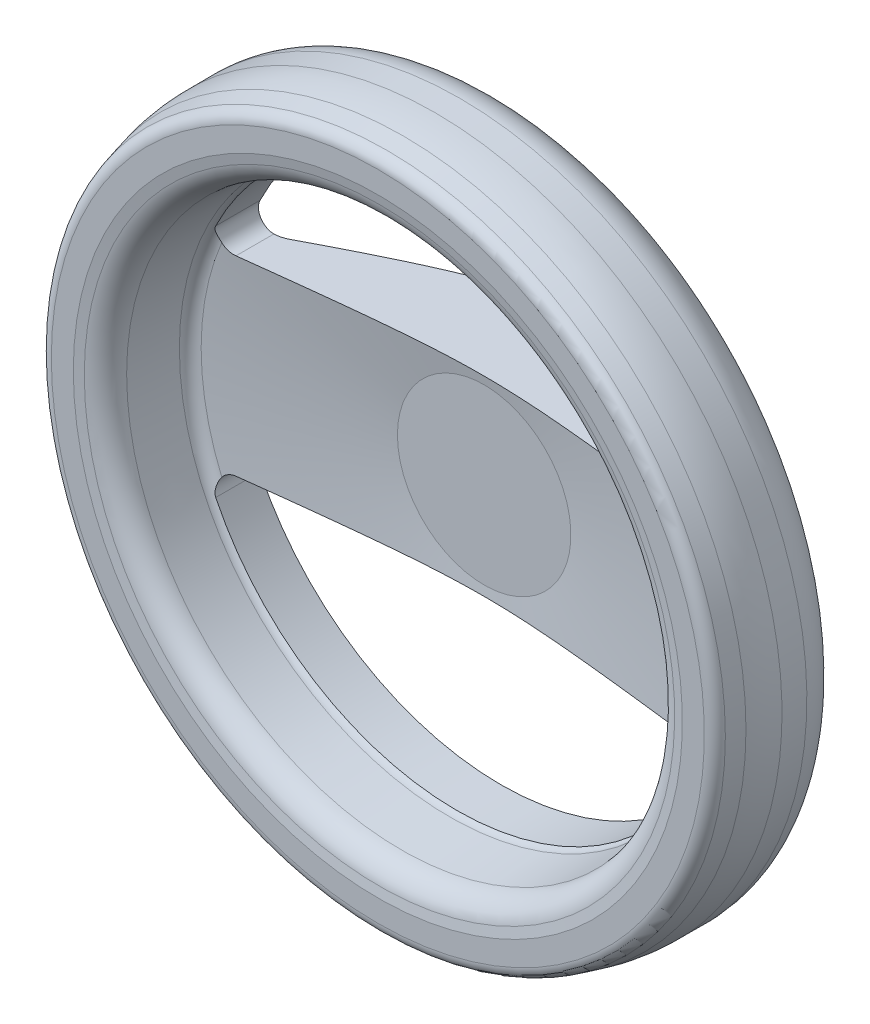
ISO-10303-21;
HEADER;
FILE_DESCRIPTION(('STEP AP214'),'2;1');
FILE_NAME('part.step','',(''),(''),'','','');
FILE_SCHEMA(('AUTOMOTIVE_DESIGN { 1 0 10303 214 1 1 1 1 }'));
ENDSEC;
DATA;
#1=APPLICATION_CONTEXT('core data for automotive mechanical design processes');
#2=APPLICATION_PROTOCOL_DEFINITION('international standard','automotive_design',2000,#1);
#3=PRODUCT_CONTEXT('',#1,'mechanical');
#4=PRODUCT('Part','Part','',(#3));
#5=PRODUCT_RELATED_PRODUCT_CATEGORY('part','',(#4));
#6=PRODUCT_DEFINITION_FORMATION('','',#4);
#7=PRODUCT_DEFINITION_CONTEXT('part definition',#1,'design');
#8=PRODUCT_DEFINITION('design','',#6,#7);
#9=PRODUCT_DEFINITION_SHAPE('','',#8);
#10=(LENGTH_UNIT() NAMED_UNIT(*) SI_UNIT(.MILLI.,.METRE.));
#11=(NAMED_UNIT(*) PLANE_ANGLE_UNIT() SI_UNIT($,.RADIAN.));
#12=(NAMED_UNIT(*) SI_UNIT($,.STERADIAN.) SOLID_ANGLE_UNIT());
#13=UNCERTAINTY_MEASURE_WITH_UNIT(LENGTH_MEASURE(1.E-05),#10,'distance_accuracy_value','');
#14=(GEOMETRIC_REPRESENTATION_CONTEXT(3) GLOBAL_UNCERTAINTY_ASSIGNED_CONTEXT((#13)) GLOBAL_UNIT_ASSIGNED_CONTEXT((#10,
#11,#12)) REPRESENTATION_CONTEXT('',''));
#15=CARTESIAN_POINT('',(0.,0.,0.));
#16=DIRECTION('',(0.,0.,1.));
#17=DIRECTION('',(1.,0.,0.));
#18=AXIS2_PLACEMENT_3D('',#15,#16,#17);
#19=CARTESIAN_POINT('',(-3.37499999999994,0.,22.));
#20=DIRECTION('',(0.,0.,-1.));
#21=DIRECTION('',(0.,1.,0.));
#22=AXIS2_PLACEMENT_3D('',#19,#20,#21);
#23=PLANE('',#22);
#24=CARTESIAN_POINT('',(0.,0.,21.9999999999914));
#25=DIRECTION('',(0.,0.,1.));
#26=DIRECTION('',(-1.,0.,0.));
#27=AXIS2_PLACEMENT_3D('',#24,#25,#26);
#28=CIRCLE('',#27,6.75000000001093);
#29=CARTESIAN_POINT('',(-6.75000000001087,0.,21.9999999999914));
#30=VERTEX_POINT('',#29);
#31=EDGE_CURVE('E579',#30,#30,#28,.F.);
#32=ORIENTED_EDGE('',*,*,#31,.T.);
#33=EDGE_LOOP('',(#32));
#34=FACE_BOUND('',#33,.T.);
#35=ADVANCED_FACE('F14',(#34),#23,.T.);
#36=CARTESIAN_POINT('',(0.,0.,22.0000000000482));
#37=DIRECTION('',(0.,0.,1.));
#38=DIRECTION('',(-1.,0.,0.));
#39=AXIS2_PLACEMENT_3D('',#36,#37,#38);
#40=CONICAL_SURFACE('',#39,6.75000000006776,0.785398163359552);
#41=ORIENTED_EDGE('',*,*,#31,.F.);
#42=EDGE_LOOP('',(#41));
#43=FACE_BOUND('',#42,.T.);
#44=CARTESIAN_POINT('',(0.,0.,21.25));
#45=DIRECTION('',(0.,0.,1.));
#46=DIRECTION('',(-1.,0.,0.));
#47=AXIS2_PLACEMENT_3D('',#44,#45,#46);
#48=CIRCLE('',#47,6.);
#49=CARTESIAN_POINT('',(-5.99999999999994,0.,21.25));
#50=VERTEX_POINT('',#49);
#51=EDGE_CURVE('E581',#50,#50,#48,.F.);
#52=ORIENTED_EDGE('',*,*,#51,.T.);
#53=EDGE_LOOP('',(#52));
#54=FACE_BOUND('',#53,.T.);
#55=ADVANCED_FACE('F907',(#43,#54),#40,.F.);
#56=CARTESIAN_POINT('',(0.,0.,10.725));
#57=DIRECTION('',(0.,0.,1.));
#58=DIRECTION('',(-1.,0.,0.));
#59=AXIS2_PLACEMENT_3D('',#56,#57,#58);
#60=CYLINDRICAL_SURFACE('',#59,6.);
#61=ORIENTED_EDGE('',*,*,#51,.F.);
#62=EDGE_LOOP('',(#61));
#63=FACE_BOUND('',#62,.T.);
#64=CARTESIAN_POINT('',(0.,0.,0.19999999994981));
#65=DIRECTION('',(0.,0.,-1.));
#66=DIRECTION('',(-1.,0.,0.));
#67=AXIS2_PLACEMENT_3D('',#64,#65,#66);
#68=CIRCLE('',#67,6.00000000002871);
#69=CARTESIAN_POINT('',(-6.00000000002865,0.,0.19999999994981));
#70=VERTEX_POINT('',#69);
#71=EDGE_CURVE('E578',#70,#70,#68,.T.);
#72=ORIENTED_EDGE('',*,*,#71,.T.);
#73=EDGE_LOOP('',(#72));
#74=FACE_BOUND('',#73,.T.);
#75=ADVANCED_FACE('F898',(#63,#74),#60,.F.);
#76=CARTESIAN_POINT('',(0.,0.,-5.68284406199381E-11));
#77=DIRECTION('',(0.,0.,-1.));
#78=DIRECTION('',(1.,0.,0.));
#79=AXIS2_PLACEMENT_3D('',#76,#77,#78);
#80=CONICAL_SURFACE('',#79,6.20000000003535,0.785398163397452);
#81=ORIENTED_EDGE('',*,*,#71,.F.);
#82=EDGE_LOOP('',(#81));
#83=FACE_BOUND('',#82,.T.);
#84=CARTESIAN_POINT('',(0.,0.,-5.67677252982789E-11));
#85=DIRECTION('',(0.,0.,-1.));
#86=DIRECTION('',(1.,0.,0.));
#87=AXIS2_PLACEMENT_3D('',#84,#85,#86);
#88=CIRCLE('',#87,6.20000000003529);
#89=CARTESIAN_POINT('',(6.20000000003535,0.,-5.67677252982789E-11));
#90=VERTEX_POINT('',#89);
#91=EDGE_CURVE('E575',#90,#90,#88,.F.);
#92=ORIENTED_EDGE('',*,*,#91,.F.);
#93=EDGE_LOOP('',(#92));
#94=FACE_BOUND('',#93,.T.);
#95=ADVANCED_FACE('F890',(#83,#94),#80,.F.);
#96=CARTESIAN_POINT('',(-8.6,0.,0.));
#97=DIRECTION('',(0.,0.,-1.));
#98=DIRECTION('',(1.,0.,0.));
#99=AXIS2_PLACEMENT_3D('',#96,#97,#98);
#100=PLANE('',#99);
#101=CARTESIAN_POINT('',(0.,0.,0.));
#102=DIRECTION('',(0.,0.,1.));
#103=DIRECTION('',(-1.,0.,0.));
#104=AXIS2_PLACEMENT_3D('',#101,#102,#103);
#105=CIRCLE('',#104,11.);
#106=CARTESIAN_POINT('',(-10.9999999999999,0.,0.));
#107=VERTEX_POINT('',#106);
#108=EDGE_CURVE('E569',#107,#107,#105,.T.);
#109=ORIENTED_EDGE('',*,*,#108,.F.);
#110=EDGE_LOOP('',(#109));
#111=FACE_BOUND('',#110,.T.);
#112=ORIENTED_EDGE('',*,*,#91,.T.);
#113=EDGE_LOOP('',(#112));
#114=FACE_BOUND('',#113,.T.);
#115=ADVANCED_FACE('F882',(#111,#114),#100,.T.);
#116=CARTESIAN_POINT('',(0.,0.,0.100000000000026));
#117=DIRECTION('',(0.,0.,1.));
#118=DIRECTION('',(-1.,0.,0.));
#119=AXIS2_PLACEMENT_3D('',#116,#117,#118);
#120=CYLINDRICAL_SURFACE('',#119,11.);
#121=ORIENTED_EDGE('',*,*,#108,.T.);
#122=EDGE_LOOP('',(#121));
#123=FACE_BOUND('',#122,.T.);
#124=CARTESIAN_POINT('',(0.,0.,0.200000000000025));
#125=DIRECTION('',(0.,0.,1.));
#126=DIRECTION('',(-1.,0.,0.));
#127=AXIS2_PLACEMENT_3D('',#124,#125,#126);
#128=CIRCLE('',#127,11.);
#129=CARTESIAN_POINT('',(-10.9999999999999,0.,0.200000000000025));
#130=VERTEX_POINT('',#129);
#131=EDGE_CURVE('E562',#130,#130,#128,.T.);
#132=ORIENTED_EDGE('',*,*,#131,.F.);
#133=EDGE_LOOP('',(#132));
#134=FACE_BOUND('',#133,.T.);
#135=ADVANCED_FACE('F466',(#123,#134),#120,.T.);
#136=CARTESIAN_POINT('',(-56.3845710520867,0.,44.));
#137=DIRECTION('',(0.,0.,1.));
#138=DIRECTION('',(0.,-1.,0.));
#139=AXIS2_PLACEMENT_3D('',#136,#137,#138);
#140=PLANE('',#139);
#141=CARTESIAN_POINT('',(0.,0.,44.));
#142=DIRECTION('',(0.,0.,1.));
#143=DIRECTION('',(-1.,0.,0.));
#144=AXIS2_PLACEMENT_3D('',#141,#142,#143);
#145=CIRCLE('',#144,54.4222222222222);
#146=CARTESIAN_POINT('',(-54.4222222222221,0.,44.));
#147=VERTEX_POINT('',#146);
#148=EDGE_CURVE('E564',#147,#147,#145,.F.);
#149=ORIENTED_EDGE('',*,*,#148,.T.);
#150=EDGE_LOOP('',(#149));
#151=FACE_BOUND('',#150,.T.);
#152=CARTESIAN_POINT('',(0.,0.,44.));
#153=DIRECTION('',(0.,0.,-1.));
#154=DIRECTION('',(0.,-1.,0.));
#155=AXIS2_PLACEMENT_3D('',#152,#153,#154);
#156=CIRCLE('',#155,58.3469198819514);
#157=CARTESIAN_POINT('',(0.,-58.3469198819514,44.));
#158=VERTEX_POINT('',#157);
#159=CARTESIAN_POINT('',(-58.3469198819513,0.,44.));
#160=VERTEX_POINT('',#159);
#161=EDGE_CURVE('E561',#158,#160,#156,.T.);
#162=ORIENTED_EDGE('',*,*,#161,.F.);
#163=CARTESIAN_POINT('',(0.,0.,44.));
#164=DIRECTION('',(0.,0.,-1.));
#165=DIRECTION('',(0.,1.,0.));
#166=AXIS2_PLACEMENT_3D('',#163,#164,#165);
#167=CIRCLE('',#166,58.3469198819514);
#168=CARTESIAN_POINT('',(0.,58.3469198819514,44.));
#169=VERTEX_POINT('',#168);
#170=EDGE_CURVE('E481',#169,#158,#167,.T.);
#171=ORIENTED_EDGE('',*,*,#170,.F.);
#172=CARTESIAN_POINT('',(0.,0.,44.));
#173=DIRECTION('',(0.,0.,-1.));
#174=DIRECTION('',(-1.,0.,0.));
#175=AXIS2_PLACEMENT_3D('',#172,#173,#174);
#176=CIRCLE('',#175,58.3469198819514);
#177=EDGE_CURVE('E444',#160,#169,#176,.T.);
#178=ORIENTED_EDGE('',*,*,#177,.F.);
#179=EDGE_LOOP('',(#162,#171,#178));
#180=FACE_BOUND('',#179,.T.);
#181=ADVANCED_FACE('F455',(#151,#180),#140,.T.);
#182=CARTESIAN_POINT('',(0.,0.,44.));
#183=DIRECTION('',(0.,0.,1.));
#184=DIRECTION('',(-1.,0.,0.));
#185=AXIS2_PLACEMENT_3D('',#182,#183,#184);
#186=CONICAL_SURFACE('',#185,54.4222222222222,1.39626340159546);
#187=CARTESIAN_POINT('',(0.,0.,43.705723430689));
#188=DIRECTION('',(0.,0.,-1.));
#189=DIRECTION('',(0.,1.,0.));
#190=AXIS2_PLACEMENT_3D('',#187,#188,#189);
#191=CIRCLE('',#190,52.7532968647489);
#192=CARTESIAN_POINT('',(0.,52.7532968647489,43.705723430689));
#193=VERTEX_POINT('',#192);
#194=EDGE_CURVE('E435',#193,#193,#191,.F.);
#195=ORIENTED_EDGE('',*,*,#194,.F.);
#196=EDGE_LOOP('',(#195));
#197=FACE_BOUND('',#196,.T.);
#198=ORIENTED_EDGE('',*,*,#148,.F.);
#199=EDGE_LOOP('',(#198));
#200=FACE_BOUND('',#199,.T.);
#201=ADVANCED_FACE('F465',(#197,#200),#186,.F.);
#202=CARTESIAN_POINT('',(-13.,0.,0.200000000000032));
#203=DIRECTION('',(0.,0.,-1.));
#204=DIRECTION('',(0.,1.,0.));
#205=AXIS2_PLACEMENT_3D('',#202,#203,#204);
#206=PLANE('',#205);
#207=CARTESIAN_POINT('',(0.,0.,0.200000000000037));
#208=DIRECTION('',(0.,0.,1.));
#209=DIRECTION('',(0.,-1.,0.));
#210=AXIS2_PLACEMENT_3D('',#207,#208,#209);
#211=CIRCLE('',#210,15.);
#212=CARTESIAN_POINT('',(0.,-15.,0.200000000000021));
#213=VERTEX_POINT('',#212);
#214=CARTESIAN_POINT('',(0.,15.,0.200000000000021));
#215=VERTEX_POINT('',#214);
#216=EDGE_CURVE('E443',#213,#215,#211,.T.);
#217=ORIENTED_EDGE('',*,*,#216,.F.);
#218=CARTESIAN_POINT('',(0.,0.,0.200000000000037));
#219=DIRECTION('',(0.,0.,1.));
#220=DIRECTION('',(-1.,0.,0.));
#221=AXIS2_PLACEMENT_3D('',#218,#219,#220);
#222=CIRCLE('',#221,15.);
#223=CARTESIAN_POINT('',(-15.,0.,0.200000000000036));
#224=VERTEX_POINT('',#223);
#225=EDGE_CURVE('E517',#224,#213,#222,.T.);
#226=ORIENTED_EDGE('',*,*,#225,.F.);
#227=CARTESIAN_POINT('',(0.,0.,0.200000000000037));
#228=DIRECTION('',(0.,0.,1.));
#229=DIRECTION('',(0.,1.,0.));
#230=AXIS2_PLACEMENT_3D('',#227,#228,#229);
#231=CIRCLE('',#230,15.);
#232=EDGE_CURVE('E521',#215,#224,#231,.T.);
#233=ORIENTED_EDGE('',*,*,#232,.F.);
#234=EDGE_LOOP('',(#217,#226,#233));
#235=FACE_BOUND('',#234,.T.);
#236=ORIENTED_EDGE('',*,*,#131,.T.);
#237=EDGE_LOOP('',(#236));
#238=FACE_BOUND('',#237,.T.);
#239=ADVANCED_FACE('F505',(#235,#238),#206,.T.);
#240=CARTESIAN_POINT('',(0.,0.,41.8));
#241=DIRECTION('',(0.,0.,-1.));
#242=DIRECTION('',(0.,1.,0.));
#243=AXIS2_PLACEMENT_3D('',#240,#241,#242);
#244=TOROIDAL_SURFACE('',#243,58.3469198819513,2.2);
#245=CARTESIAN_POINT('',(0.,0.,42.3694018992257));
#246=DIRECTION('',(0.,0.,-1.));
#247=DIRECTION('',(-1.,0.,0.));
#248=AXIS2_PLACEMENT_3D('',#245,#246,#247);
#249=CIRCLE('',#248,60.4719566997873);
#250=CARTESIAN_POINT('',(-60.4719566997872,0.,42.3694018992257));
#251=VERTEX_POINT('',#250);
#252=EDGE_CURVE('E513',#251,#251,#249,.T.);
#253=ORIENTED_EDGE('',*,*,#252,.F.);
#254=EDGE_LOOP('',(#253));
#255=FACE_BOUND('',#254,.T.);
#256=ORIENTED_EDGE('',*,*,#161,.T.);
#257=ORIENTED_EDGE('',*,*,#177,.T.);
#258=ORIENTED_EDGE('',*,*,#170,.T.);
#259=EDGE_LOOP('',(#256,#257,#258));
#260=FACE_BOUND('',#259,.T.);
#261=ADVANCED_FACE('F496',(#255,#260),#244,.T.);
#262=CARTESIAN_POINT('',(0.,0.,39.3725693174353));
#263=DIRECTION('',(0.,0.,-1.));
#264=DIRECTION('',(0.,1.,0.));
#265=AXIS2_PLACEMENT_3D('',#262,#263,#264);
#266=TOROIDAL_SURFACE('',#265,53.5173488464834,4.4);
#267=CARTESIAN_POINT('',(0.,0.,39.7560545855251));
#268=DIRECTION('',(0.,0.,1.));
#269=DIRECTION('',(-1.,0.,0.));
#270=AXIS2_PLACEMENT_3D('',#267,#268,#269);
#271=CIRCLE('',#270,49.1340921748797);
#272=CARTESIAN_POINT('',(-49.1340921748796,0.,39.756054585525));
#273=VERTEX_POINT('',#272);
#274=EDGE_CURVE('E516',#273,#273,#271,.F.);
#275=ORIENTED_EDGE('',*,*,#274,.T.);
#276=EDGE_LOOP('',(#275));
#277=FACE_BOUND('',#276,.T.);
#278=ORIENTED_EDGE('',*,*,#194,.T.);
#279=EDGE_LOOP('',(#278));
#280=FACE_BOUND('',#279,.T.);
#281=ADVANCED_FACE('F418',(#277,#280),#266,.T.);
#282=CARTESIAN_POINT('',(0.,0.,0.700000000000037));
#283=DIRECTION('',(0.,0.,-1.));
#284=DIRECTION('',(0.,1.,0.));
#285=AXIS2_PLACEMENT_3D('',#282,#283,#284);
#286=TOROIDAL_SURFACE('',#285,15.,0.5);
#287=ORIENTED_EDGE('',*,*,#216,.T.);
#288=ORIENTED_EDGE('',*,*,#232,.T.);
#289=ORIENTED_EDGE('',*,*,#225,.T.);
#290=EDGE_LOOP('',(#287,#288,#289));
#291=FACE_BOUND('',#290,.T.);
#292=CARTESIAN_POINT('',(0.,0.,0.700000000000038));
#293=DIRECTION('',(0.,0.,1.));
#294=DIRECTION('',(-1.,0.,0.));
#295=AXIS2_PLACEMENT_3D('',#292,#293,#294);
#296=CIRCLE('',#295,15.5);
#297=CARTESIAN_POINT('',(-15.4999999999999,0.,0.700000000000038));
#298=VERTEX_POINT('',#297);
#299=EDGE_CURVE('E407',#298,#298,#296,.T.);
#300=ORIENTED_EDGE('',*,*,#299,.F.);
#301=EDGE_LOOP('',(#300));
#302=FACE_BOUND('',#301,.T.);
#303=ADVANCED_FACE('F412',(#291,#302),#286,.T.);
#304=CARTESIAN_POINT('',(0.,0.,39.4643307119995));
#305=DIRECTION('',(0.,0.,-1.));
#306=DIRECTION('',(1.,0.,0.));
#307=AXIS2_PLACEMENT_3D('',#304,#305,#306);
#308=CONICAL_SURFACE('',#307,61.2503681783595,0.261799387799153);
#309=CARTESIAN_POINT('',(0.,0.,39.4643307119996));
#310=DIRECTION('',(0.,0.,-1.));
#311=DIRECTION('',(0.,1.,0.));
#312=AXIS2_PLACEMENT_3D('',#309,#310,#311);
#313=CIRCLE('',#312,61.2503681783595);
#314=CARTESIAN_POINT('',(0.,61.2503681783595,39.4643307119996));
#315=VERTEX_POINT('',#314);
#316=EDGE_CURVE('E390',#315,#315,#313,.T.);
#317=ORIENTED_EDGE('',*,*,#316,.F.);
#318=EDGE_LOOP('',(#317));
#319=FACE_BOUND('',#318,.T.);
#320=ORIENTED_EDGE('',*,*,#252,.T.);
#321=EDGE_LOOP('',(#320));
#322=FACE_BOUND('',#321,.T.);
#323=ADVANCED_FACE('F417',(#319,#322),#308,.T.);
#324=CARTESIAN_POINT('',(-7.75,0.,25.));
#325=DIRECTION('',(0.,0.,1.));
#326=DIRECTION('',(0.,-1.,0.));
#327=AXIS2_PLACEMENT_3D('',#324,#325,#326);
#328=PLANE('',#327);
#329=CARTESIAN_POINT('',(0.,0.,25.));
#330=DIRECTION('',(0.,0.,1.));
#331=DIRECTION('',(-1.,0.,0.));
#332=AXIS2_PLACEMENT_3D('',#329,#330,#331);
#333=CIRCLE('',#332,15.5);
#334=CARTESIAN_POINT('',(-15.4999999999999,0.,25.));
#335=VERTEX_POINT('',#334);
#336=EDGE_CURVE('E389',#335,#335,#333,.T.);
#337=ORIENTED_EDGE('',*,*,#336,.T.);
#338=EDGE_LOOP('',(#337));
#339=FACE_BOUND('',#338,.T.);
#340=ADVANCED_FACE('F730',(#339),#328,.T.);
#341=CARTESIAN_POINT('',(0.,0.,39.7560545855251));
#342=DIRECTION('',(0.,0.,1.));
#343=DIRECTION('',(-1.,0.,0.));
#344=AXIS2_PLACEMENT_3D('',#341,#342,#343);
#345=CONICAL_SURFACE('',#344,49.1340921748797,0.0872664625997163);
#346=CARTESIAN_POINT('',(0.,0.,31.0909284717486));
#347=DIRECTION('',(0.,0.,-1.));
#348=DIRECTION('',(0.,1.,0.));
#349=AXIS2_PLACEMENT_3D('',#346,#347,#348);
#350=CIRCLE('',#349,48.3759918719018);
#351=CARTESIAN_POINT('',(0.,48.3759918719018,31.0909284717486));
#352=VERTEX_POINT('',#351);
#353=EDGE_CURVE('E381',#352,#352,#350,.T.);
#354=ORIENTED_EDGE('',*,*,#353,.T.);
#355=EDGE_LOOP('',(#354));
#356=FACE_BOUND('',#355,.T.);
#357=ORIENTED_EDGE('',*,*,#274,.F.);
#358=EDGE_LOOP('',(#357));
#359=FACE_BOUND('',#358,.T.);
#360=ADVANCED_FACE('F726',(#356,#359),#345,.F.);
#361=CARTESIAN_POINT('',(0.,0.,3.47500000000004));
#362=DIRECTION('',(0.,0.,1.));
#363=DIRECTION('',(-1.,0.,0.));
#364=AXIS2_PLACEMENT_3D('',#361,#362,#363);
#365=CYLINDRICAL_SURFACE('',#364,15.5);
#366=CARTESIAN_POINT('',(0.,0.,6.25000000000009));
#367=DIRECTION('',(0.,0.,1.));
#368=DIRECTION('',(-1.,0.,0.));
#369=AXIS2_PLACEMENT_3D('',#366,#367,#368);
#370=CIRCLE('',#369,15.5);
#371=CARTESIAN_POINT('',(-15.4999999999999,0.,6.25000000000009));
#372=VERTEX_POINT('',#371);
#373=EDGE_CURVE('E160',#372,#372,#370,.T.);
#374=ORIENTED_EDGE('',*,*,#373,.F.);
#375=EDGE_LOOP('',(#374));
#376=FACE_BOUND('',#375,.T.);
#377=ORIENTED_EDGE('',*,*,#299,.T.);
#378=EDGE_LOOP('',(#377));
#379=FACE_BOUND('',#378,.T.);
#380=ADVANCED_FACE('F729',(#376,#379),#365,.T.);
#381=CARTESIAN_POINT('',(0.,0.,33.770311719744));
#382=DIRECTION('',(0.,0.,-1.));
#383=DIRECTION('',(0.,1.,0.));
#384=AXIS2_PLACEMENT_3D('',#381,#382,#383);
#385=TOROIDAL_SURFACE('',#384,40.,21.9999999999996);
#386=ORIENTED_EDGE('',*,*,#316,.T.);
#387=EDGE_LOOP('',(#386));
#388=FACE_BOUND('',#387,.T.);
#389=CARTESIAN_POINT('',(0.,0.,33.7703117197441));
#390=DIRECTION('',(0.,0.,1.));
#391=DIRECTION('',(-1.,0.,0.));
#392=AXIS2_PLACEMENT_3D('',#389,#390,#391);
#393=CIRCLE('',#392,62.);
#394=CARTESIAN_POINT('',(-61.9999999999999,0.,33.7703117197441));
#395=VERTEX_POINT('',#394);
#396=EDGE_CURVE('E318',#395,#395,#393,.F.);
#397=ORIENTED_EDGE('',*,*,#396,.F.);
#398=EDGE_LOOP('',(#397));
#399=FACE_BOUND('',#398,.T.);
#400=ADVANCED_FACE('F334',(#388,#399),#385,.T.);
#401=CARTESIAN_POINT('',(0.,0.,29.1017118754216));
#402=DIRECTION('',(0.,0.,1.));
#403=DIRECTION('',(-1.,0.,0.));
#404=AXIS2_PLACEMENT_3D('',#401,#402,#403);
#405=CONICAL_SURFACE('',#404,46.4731832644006,1.43913457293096);
#406=ORIENTED_EDGE('',*,*,#336,.F.);
#407=EDGE_LOOP('',(#406));
#408=FACE_BOUND('',#407,.T.);
#409=CARTESIAN_POINT('',(40.5780941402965,-17.05,28.7761258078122));
#410=CARTESIAN_POINT('',(40.6562931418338,-17.0499927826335,28.7856728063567));
#411=CARTESIAN_POINT('',(40.7344668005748,-17.053328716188,28.7953919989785));
#412=CARTESIAN_POINT('',(40.8902113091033,-17.0666201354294,28.8151000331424));
#413=CARTESIAN_POINT('',(40.9677821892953,-17.0765752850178,28.8250888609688));
#414=CARTESIAN_POINT('',(41.1217245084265,-17.1030293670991,28.8452555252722));
#415=CARTESIAN_POINT('',(41.1980967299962,-17.1195238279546,28.8554332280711));
#416=CARTESIAN_POINT('',(41.3491313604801,-17.1589187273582,28.8759058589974));
#417=CARTESIAN_POINT('',(41.4237938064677,-17.1818190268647,28.8862007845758));
#418=CARTESIAN_POINT('',(41.6445223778,-17.2599441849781,28.9171647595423));
#419=CARTESIAN_POINT('',(41.7873628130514,-17.3245990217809,28.937917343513));
#420=CARTESIAN_POINT('',(42.0599390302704,-17.477119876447,28.9789993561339));
#421=CARTESIAN_POINT('',(42.1896844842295,-17.5649685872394,28.9993290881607));
#422=CARTESIAN_POINT('',(42.3991447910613,-17.7343966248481,29.0335701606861));
#423=CARTESIAN_POINT('',(42.4828209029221,-17.8110858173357,29.0477124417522));
#424=CARTESIAN_POINT('',(42.6401398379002,-17.9741839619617,29.0752884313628));
#425=CARTESIAN_POINT('',(42.7137873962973,-18.0605882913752,29.0887224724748));
#426=CARTESIAN_POINT('',(42.7818516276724,-18.1513066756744,29.1017118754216));
#427=B_SPLINE_CURVE_WITH_KNOTS('',3,(#409,#410,#411,#412,#413,#414,#415,#416,#417,#418,#419,
#420,#421,#422,#423,#424,#425,#426),.UNSPECIFIED.,.F.,.F.,(4,2,2,2,2,2,2,2,4),(0.,
0.236260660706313,0.472509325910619,0.708596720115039,0.944678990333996,1.41674327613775,
1.888456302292,2.23077792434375,2.57293734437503),.UNSPECIFIED.);
#428=CARTESIAN_POINT('',(40.5780941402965,-17.05,28.7761258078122));
#429=VERTEX_POINT('',#428);
#430=CARTESIAN_POINT('',(42.7818516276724,-18.1513066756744,29.1017118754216));
#431=VERTEX_POINT('',#430);
#432=EDGE_CURVE('E340',#429,#431,#427,.T.);
#433=ORIENTED_EDGE('',*,*,#432,.T.);
#434=CARTESIAN_POINT('',(0.,0.,29.1017118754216));
#435=DIRECTION('',(0.,0.,1.));
#436=DIRECTION('',(-1.,0.,0.));
#437=AXIS2_PLACEMENT_3D('',#434,#435,#436);
#438=CIRCLE('',#437,46.4731832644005);
#439=CARTESIAN_POINT('',(42.7818516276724,18.1513066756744,29.1017118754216));
#440=VERTEX_POINT('',#439);
#441=EDGE_CURVE('E387',#440,#431,#438,.F.);
#442=ORIENTED_EDGE('',*,*,#441,.F.);
#443=CARTESIAN_POINT('',(42.7818516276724,18.1513066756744,29.1017118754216));
#444=CARTESIAN_POINT('',(42.7349272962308,18.0887827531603,29.0927575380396));
#445=CARTESIAN_POINT('',(42.6853480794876,18.0282877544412,29.0835908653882));
#446=CARTESIAN_POINT('',(42.581268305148,17.9117572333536,29.0648960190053));
#447=CARTESIAN_POINT('',(42.5267680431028,17.855721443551,29.0553678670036));
#448=CARTESIAN_POINT('',(42.4132742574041,17.7485462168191,29.0360198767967));
#449=CARTESIAN_POINT('',(42.3542843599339,17.69740290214,29.0262002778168));
#450=CARTESIAN_POINT('',(42.232224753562,17.6003284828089,29.0063322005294));
#451=CARTESIAN_POINT('',(42.1691551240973,17.5543972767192,28.9962837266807));
#452=CARTESIAN_POINT('',(41.9744011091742,17.4248664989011,28.9658830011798));
#453=CARTESIAN_POINT('',(41.8371414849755,17.3495013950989,28.945270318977));
#454=CARTESIAN_POINT('',(41.5519997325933,17.2231310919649,28.903979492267));
#455=CARTESIAN_POINT('',(41.4041248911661,17.1721093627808,28.8833014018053));
#456=CARTESIAN_POINT('',(41.1428552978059,17.1061019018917,28.8479955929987));
#457=CARTESIAN_POINT('',(41.03096298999,17.0850999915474,28.8332453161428));
#458=CARTESIAN_POINT('',(40.8054412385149,17.0570393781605,28.8042521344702));
#459=CARTESIAN_POINT('',(40.6918127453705,17.0499733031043,28.7900089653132));
#460=CARTESIAN_POINT('',(40.5780941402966,17.05,28.7761258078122));
#461=B_SPLINE_CURVE_WITH_KNOTS('',3,(#443,#444,#445,#446,#447,#448,#449,#450,#451,#452,#453,
#454,#455,#456,#457,#458,#459,#460),.UNSPECIFIED.,.F.,.F.,(4,2,2,2,2,2,2,2,4),(0.,
0.235976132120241,0.471938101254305,0.707711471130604,0.943480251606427,1.41489432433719,
1.88598783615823,2.22955468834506,2.57293974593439),.UNSPECIFIED.);
#462=CARTESIAN_POINT('',(40.5780941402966,17.05,28.7761258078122));
#463=VERTEX_POINT('',#462);
#464=EDGE_CURVE('E238',#440,#463,#461,.T.);
#465=ORIENTED_EDGE('',*,*,#464,.T.);
#466=CARTESIAN_POINT('',(40.5780941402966,17.05,28.7761258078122));
#467=CARTESIAN_POINT('',(39.7277637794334,17.05,28.6723177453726));
#468=CARTESIAN_POINT('',(38.8773759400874,17.05,28.5689781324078));
#469=CARTESIAN_POINT('',(37.1764613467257,17.05,28.3634396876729));
#470=CARTESIAN_POINT('',(36.3259345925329,17.05,28.261240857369));
#471=CARTESIAN_POINT('',(34.6246992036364,17.05,28.0581855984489));
#472=CARTESIAN_POINT('',(33.773990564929,17.05,27.9573292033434));
#473=CARTESIAN_POINT('',(32.0723836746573,17.05,27.7572291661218));
#474=CARTESIAN_POINT('',(31.221485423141,17.05,27.6579855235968));
#475=CARTESIAN_POINT('',(29.5164301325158,17.05,27.4610939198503));
#476=CARTESIAN_POINT('',(28.6622722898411,17.05,27.3634529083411));
#477=CARTESIAN_POINT('',(26.9536870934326,17.05,27.1705591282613));
#478=CARTESIAN_POINT('',(26.0992597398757,17.05,27.0753063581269));
#479=CARTESIAN_POINT('',(24.3900834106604,17.05,26.8877361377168));
#480=CARTESIAN_POINT('',(23.5353344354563,17.05,26.7954186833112));
#481=CARTESIAN_POINT('',(21.8254501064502,17.05,26.6144212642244));
#482=CARTESIAN_POINT('',(20.9703147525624,17.05,26.5257413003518));
#483=CARTESIAN_POINT('',(19.2668957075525,17.05,26.3536612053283));
#484=CARTESIAN_POINT('',(18.4186159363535,17.05,26.2702224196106));
#485=CARTESIAN_POINT('',(16.7215217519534,17.05,26.1089358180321));
#486=CARTESIAN_POINT('',(15.8727073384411,17.05,26.0310880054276));
#487=CARTESIAN_POINT('',(14.1744182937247,17.05,25.8824029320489));
#488=CARTESIAN_POINT('',(13.3249436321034,17.05,25.8115660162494));
#489=CARTESIAN_POINT('',(11.6253014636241,17.05,25.6786581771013));
#490=CARTESIAN_POINT('',(10.7751339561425,17.05,25.6165872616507));
#491=CARTESIAN_POINT('',(9.07570312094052,17.05,25.5033732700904));
#492=CARTESIAN_POINT('',(8.22644119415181,17.05,25.4522094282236));
#493=CARTESIAN_POINT('',(6.52723756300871,17.05,25.3628608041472));
#494=CARTESIAN_POINT('',(5.67729586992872,17.05,25.3246758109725));
#495=CARTESIAN_POINT('',(3.97698732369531,17.05,25.2633441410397));
#496=CARTESIAN_POINT('',(3.12662055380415,17.05,25.2401952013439));
#497=CARTESIAN_POINT('',(1.42559687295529,17.05,25.2103918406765));
#498=CARTESIAN_POINT('',(0.57493996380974,17.05,25.2037373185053));
#499=CARTESIAN_POINT('',(-1.11494946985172,17.05,25.2073549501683));
#500=CARTESIAN_POINT('',(-1.95418247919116,17.05,25.2174016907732));
#501=CARTESIAN_POINT('',(-3.63230278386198,17.05,25.253323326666));
#502=CARTESIAN_POINT('',(-4.47119007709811,17.05,25.2791983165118));
#503=CARTESIAN_POINT('',(-6.9872393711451,17.05,25.3782765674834));
#504=CARTESIAN_POINT('',(-8.66356768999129,17.05,25.4729319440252));
#505=CARTESIAN_POINT('',(-11.1774071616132,17.05,25.6455201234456));
#506=CARTESIAN_POINT('',(-12.0160566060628,17.05,25.7082259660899));
#507=CARTESIAN_POINT('',(-13.6927050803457,17.05,25.841893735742));
#508=CARTESIAN_POINT('',(-14.5307041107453,17.05,25.9128556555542));
#509=CARTESIAN_POINT('',(-16.2060613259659,17.05,26.0613992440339));
#510=CARTESIAN_POINT('',(-17.0434195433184,17.05,26.1389805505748));
#511=CARTESIAN_POINT('',(-18.7176266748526,17.05,26.2994372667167));
#512=CARTESIAN_POINT('',(-19.5544755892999,17.05,26.382312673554));
#513=CARTESIAN_POINT('',(-21.2348579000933,17.05,26.5530283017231));
#514=CARTESIAN_POINT('',(-22.0783875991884,17.05,26.6409047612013));
#515=CARTESIAN_POINT('',(-23.7650773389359,17.05,26.8201259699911));
#516=CARTESIAN_POINT('',(-24.6082373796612,17.05,26.9114707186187));
#517=CARTESIAN_POINT('',(-26.2942522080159,17.05,27.0969694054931));
#518=CARTESIAN_POINT('',(-27.1371069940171,17.05,27.1911233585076));
#519=CARTESIAN_POINT('',(-28.8225573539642,17.05,27.3817244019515));
#520=CARTESIAN_POINT('',(-29.6651529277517,17.05,27.4781714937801));
#521=CARTESIAN_POINT('',(-31.3472084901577,17.05,27.6726163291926));
#522=CARTESIAN_POINT('',(-32.1866692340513,17.05,27.7706075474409));
#523=CARTESIAN_POINT('',(-33.8654073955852,17.05,27.9681482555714));
#524=CARTESIAN_POINT('',(-34.7046848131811,17.05,28.0676977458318));
#525=CARTESIAN_POINT('',(-36.3830609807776,17.05,28.2680970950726));
#526=CARTESIAN_POINT('',(-37.222159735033,17.05,28.3689469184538));
#527=CARTESIAN_POINT('',(-38.9002223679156,17.05,28.5717543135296));
#528=CARTESIAN_POINT('',(-39.7391862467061,17.05,28.6737118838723));
#529=CARTESIAN_POINT('',(-40.5780941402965,17.05,28.7761258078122));
#530=B_SPLINE_CURVE_WITH_KNOTS('',3,(#466,#467,#468,#469,#470,#471,#472,#473,#474,#475,#476,
#477,#478,#479,#480,#481,#482,#483,#484,#485,#486,#487,#488,#489,#490,#491,#492,#493,#494,#495,
#496,#497,#498,#499,#500,#501,#502,#503,#504,#505,#506,#507,#508,#509,#510,#511,#512,#513,#514,
#515,#516,#517,#518,#519,#520,#521,#522,#523,#524,#525,#526,#527,#528,#529),.UNSPECIFIED.,.F.,
.F.,(4,2,2,2,2,2,2,2,2,2,2,2,2,2,2,2,2,2,2,2,2,2,2,2,2,2,2,2,2,2,2,4),(0.,2.56993036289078,
5.13986402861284,7.70986172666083,10.2798587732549,12.8590176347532,15.4381748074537,
18.0173283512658,20.5964824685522,23.153588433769,25.7106958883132,28.2679291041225,
30.8251646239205,33.3774871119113,35.9297681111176,38.4816649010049,41.0335460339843,
43.5512638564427,46.0689967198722,51.1051253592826,53.6280806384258,56.1510337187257,
58.6738488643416,61.1966626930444,63.7409381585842,66.2852131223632,68.8295014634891,
71.3737913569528,73.9092717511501,76.4447527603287,78.9801645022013,81.5155731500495),.UNSPECIFIED.);
#531=CARTESIAN_POINT('',(-40.5780941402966,17.05,28.7761258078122));
#532=VERTEX_POINT('',#531);
#533=EDGE_CURVE('E159',#463,#532,#530,.T.);
#534=ORIENTED_EDGE('',*,*,#533,.T.);
#535=CARTESIAN_POINT('',(-40.5780941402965,17.05,28.7761258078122));
#536=CARTESIAN_POINT('',(-40.6562931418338,17.0499927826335,28.7856728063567));
#537=CARTESIAN_POINT('',(-40.7344668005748,17.053328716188,28.7953919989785));
#538=CARTESIAN_POINT('',(-40.8902113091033,17.0666201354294,28.8151000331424));
#539=CARTESIAN_POINT('',(-40.9677821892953,17.0765752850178,28.8250888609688));
#540=CARTESIAN_POINT('',(-41.1217245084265,17.1030293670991,28.8452555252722));
#541=CARTESIAN_POINT('',(-41.1980967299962,17.1195238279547,28.8554332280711));
#542=CARTESIAN_POINT('',(-41.3491313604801,17.1589187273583,28.8759058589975));
#543=CARTESIAN_POINT('',(-41.4237938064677,17.1818190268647,28.8862007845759));
#544=CARTESIAN_POINT('',(-41.6445223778,17.2599441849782,28.9171647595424));
#545=CARTESIAN_POINT('',(-41.7873628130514,17.3245990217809,28.9379173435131));
#546=CARTESIAN_POINT('',(-42.0599390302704,17.4771198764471,28.9789993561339));
#547=CARTESIAN_POINT('',(-42.1896844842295,17.5649685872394,28.9993290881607));
#548=CARTESIAN_POINT('',(-42.3991447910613,17.7343966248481,29.0335701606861));
#549=CARTESIAN_POINT('',(-42.4828209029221,17.8110858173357,29.0477124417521));
#550=CARTESIAN_POINT('',(-42.6401398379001,17.9741839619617,29.0752884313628));
#551=CARTESIAN_POINT('',(-42.7137873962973,18.0605882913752,29.0887224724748));
#552=CARTESIAN_POINT('',(-42.7818516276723,18.1513066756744,29.1017118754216));
#553=B_SPLINE_CURVE_WITH_KNOTS('',3,(#535,#536,#537,#538,#539,#540,#541,#542,#543,#544,#545,
#546,#547,#548,#549,#550,#551,#552),.UNSPECIFIED.,.F.,.F.,(4,2,2,2,2,2,2,2,4),(0.,
0.236260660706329,0.472509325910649,0.708596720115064,0.944678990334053,1.4167432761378,
1.88845630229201,2.23077792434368,2.5729373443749),.UNSPECIFIED.);
#554=CARTESIAN_POINT('',(-42.7818516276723,18.1513066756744,29.1017118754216));
#555=VERTEX_POINT('',#554);
#556=EDGE_CURVE('E228',#532,#555,#553,.T.);
#557=ORIENTED_EDGE('',*,*,#556,.T.);
#558=CARTESIAN_POINT('',(0.,0.,29.1017118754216));
#559=DIRECTION('',(0.,0.,-1.));
#560=DIRECTION('',(0.,1.,0.));
#561=AXIS2_PLACEMENT_3D('',#558,#559,#560);
#562=CIRCLE('',#561,46.4731832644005);
#563=CARTESIAN_POINT('',(-42.7818516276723,-18.1513066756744,29.1017118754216));
#564=VERTEX_POINT('',#563);
#565=EDGE_CURVE('E379',#555,#564,#562,.F.);
#566=ORIENTED_EDGE('',*,*,#565,.T.);
#567=CARTESIAN_POINT('',(-42.7818516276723,-18.1513066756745,29.1017118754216));
#568=CARTESIAN_POINT('',(-42.7349272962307,-18.0887827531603,29.0927575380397));
#569=CARTESIAN_POINT('',(-42.6853480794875,-18.0282877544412,29.0835908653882));
#570=CARTESIAN_POINT('',(-42.5812683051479,-17.9117572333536,29.0648960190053));
#571=CARTESIAN_POINT('',(-42.5267680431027,-17.855721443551,29.0553678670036));
#572=CARTESIAN_POINT('',(-42.413274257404,-17.7485462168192,29.0360198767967));
#573=CARTESIAN_POINT('',(-42.3542843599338,-17.69740290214,29.0262002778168));
#574=CARTESIAN_POINT('',(-42.2322247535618,-17.600328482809,29.0063322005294));
#575=CARTESIAN_POINT('',(-42.1691551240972,-17.5543972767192,28.9962837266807));
#576=CARTESIAN_POINT('',(-41.9744011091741,-17.4248664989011,28.9658830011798));
#577=CARTESIAN_POINT('',(-41.8371414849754,-17.3495013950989,28.945270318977));
#578=CARTESIAN_POINT('',(-41.5519997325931,-17.2231310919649,28.903979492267));
#579=CARTESIAN_POINT('',(-41.404124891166,-17.1721093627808,28.8833014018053));
#580=CARTESIAN_POINT('',(-41.1428552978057,-17.1061019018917,28.8479955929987));
#581=CARTESIAN_POINT('',(-41.0309629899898,-17.0850999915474,28.8332453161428));
#582=CARTESIAN_POINT('',(-40.8054412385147,-17.0570393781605,28.8042521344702));
#583=CARTESIAN_POINT('',(-40.6918127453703,-17.0499733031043,28.7900089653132));
#584=CARTESIAN_POINT('',(-40.5780941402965,-17.05,28.7761258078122));
#585=B_SPLINE_CURVE_WITH_KNOTS('',3,(#567,#568,#569,#570,#571,#572,#573,#574,#575,#576,#577,
#578,#579,#580,#581,#582,#583,#584),.UNSPECIFIED.,.F.,.F.,(4,2,2,2,2,2,2,2,4),(0.,
0.235976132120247,0.471938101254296,0.707711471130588,0.943480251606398,1.4148943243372,
1.88598783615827,2.22955468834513,2.57293974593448),.UNSPECIFIED.);
#586=CARTESIAN_POINT('',(-40.5780941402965,-17.05,28.7761258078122));
#587=VERTEX_POINT('',#586);
#588=EDGE_CURVE('E361',#564,#587,#585,.T.);
#589=ORIENTED_EDGE('',*,*,#588,.T.);
#590=CARTESIAN_POINT('',(-40.5780941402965,-17.05,28.7761258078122));
#591=CARTESIAN_POINT('',(-39.7277637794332,-17.05,28.6723177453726));
#592=CARTESIAN_POINT('',(-38.8773759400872,-17.05,28.5689781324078));
#593=CARTESIAN_POINT('',(-37.1764613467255,-17.05,28.3634396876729));
#594=CARTESIAN_POINT('',(-36.3259345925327,-17.05,28.261240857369));
#595=CARTESIAN_POINT('',(-34.6246992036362,-17.05,28.0581855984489));
#596=CARTESIAN_POINT('',(-33.7739905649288,-17.05,27.9573292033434));
#597=CARTESIAN_POINT('',(-32.0723836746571,-17.05,27.7572291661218));
#598=CARTESIAN_POINT('',(-31.2214854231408,-17.05,27.6579855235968));
#599=CARTESIAN_POINT('',(-29.5164301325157,-17.05,27.4610939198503));
#600=CARTESIAN_POINT('',(-28.6622722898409,-17.05,27.3634529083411));
#601=CARTESIAN_POINT('',(-26.9536870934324,-17.05,27.1705591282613));
#602=CARTESIAN_POINT('',(-26.0992597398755,-17.05,27.0753063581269));
#603=CARTESIAN_POINT('',(-24.3900834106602,-17.05,26.8877361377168));
#604=CARTESIAN_POINT('',(-23.5353344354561,-17.05,26.7954186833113));
#605=CARTESIAN_POINT('',(-21.82545010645,-17.05,26.6144212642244));
#606=CARTESIAN_POINT('',(-20.9703147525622,-17.05,26.5257413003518));
#607=CARTESIAN_POINT('',(-19.2668957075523,-17.05,26.3536612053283));
#608=CARTESIAN_POINT('',(-18.4186159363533,-17.05,26.2702224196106));
#609=CARTESIAN_POINT('',(-16.7215217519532,-17.05,26.1089358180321));
#610=CARTESIAN_POINT('',(-15.872707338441,-17.05,26.0310880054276));
#611=CARTESIAN_POINT('',(-14.1744182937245,-17.05,25.8824029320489));
#612=CARTESIAN_POINT('',(-13.3249436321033,-17.05,25.8115660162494));
#613=CARTESIAN_POINT('',(-11.6253014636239,-17.05,25.6786581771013));
#614=CARTESIAN_POINT('',(-10.7751339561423,-17.05,25.6165872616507));
#615=CARTESIAN_POINT('',(-9.07570312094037,-17.05,25.5033732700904));
#616=CARTESIAN_POINT('',(-8.22644119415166,-17.05,25.4522094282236));
#617=CARTESIAN_POINT('',(-6.52723756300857,-17.05,25.3628608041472));
#618=CARTESIAN_POINT('',(-5.67729586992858,-17.05,25.3246758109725));
#619=CARTESIAN_POINT('',(-3.97698732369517,-17.05,25.2633441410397));
#620=CARTESIAN_POINT('',(-3.12662055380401,-17.05,25.2401952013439));
#621=CARTESIAN_POINT('',(-1.42559687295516,-17.05,25.2103918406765));
#622=CARTESIAN_POINT('',(-0.57493996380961,-17.05,25.2037373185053));
#623=CARTESIAN_POINT('',(1.11494946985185,-17.05,25.2073549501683));
#624=CARTESIAN_POINT('',(1.95418247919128,-17.05,25.2174016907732));
#625=CARTESIAN_POINT('',(3.6323027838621,-17.05,25.253323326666));
#626=CARTESIAN_POINT('',(4.47119007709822,-17.05,25.2791983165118));
#627=CARTESIAN_POINT('',(6.9872393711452,-17.05,25.3782765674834));
#628=CARTESIAN_POINT('',(8.66356768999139,-17.05,25.4729319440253));
#629=CARTESIAN_POINT('',(11.1774071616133,-17.05,25.6455201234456));
#630=CARTESIAN_POINT('',(12.0160566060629,-17.05,25.7082259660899));
#631=CARTESIAN_POINT('',(13.6927050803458,-17.05,25.841893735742));
#632=CARTESIAN_POINT('',(14.5307041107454,-17.05,25.9128556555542));
#633=CARTESIAN_POINT('',(16.2060613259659,-17.05,26.0613992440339));
#634=CARTESIAN_POINT('',(17.0434195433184,-17.05,26.1389805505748));
#635=CARTESIAN_POINT('',(18.7176266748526,-17.05,26.2994372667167));
#636=CARTESIAN_POINT('',(19.5544755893,-17.05,26.382312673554));
#637=CARTESIAN_POINT('',(21.2348579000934,-17.05,26.5530283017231));
#638=CARTESIAN_POINT('',(22.0783875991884,-17.05,26.6409047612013));
#639=CARTESIAN_POINT('',(23.7650773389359,-17.05,26.8201259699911));
#640=CARTESIAN_POINT('',(24.6082373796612,-17.05,26.9114707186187));
#641=CARTESIAN_POINT('',(26.294252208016,-17.05,27.0969694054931));
#642=CARTESIAN_POINT('',(27.1371069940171,-17.05,27.1911233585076));
#643=CARTESIAN_POINT('',(28.8225573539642,-17.05,27.3817244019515));
#644=CARTESIAN_POINT('',(29.6651529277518,-17.05,27.4781714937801));
#645=CARTESIAN_POINT('',(31.3472084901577,-17.05,27.6726163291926));
#646=CARTESIAN_POINT('',(32.1866692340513,-17.05,27.7706075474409));
#647=CARTESIAN_POINT('',(33.8654073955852,-17.05,27.9681482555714));
#648=CARTESIAN_POINT('',(34.7046848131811,-17.05,28.0676977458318));
#649=CARTESIAN_POINT('',(36.3830609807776,-17.05,28.2680970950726));
#650=CARTESIAN_POINT('',(37.222159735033,-17.05,28.3689469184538));
#651=CARTESIAN_POINT('',(38.9002223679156,-17.05,28.5717543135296));
#652=CARTESIAN_POINT('',(39.7391862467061,-17.05,28.6737118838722));
#653=CARTESIAN_POINT('',(40.5780941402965,-17.05,28.7761258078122));
#654=B_SPLINE_CURVE_WITH_KNOTS('',3,(#590,#591,#592,#593,#594,#595,#596,#597,#598,#599,#600,
#601,#602,#603,#604,#605,#606,#607,#608,#609,#610,#611,#612,#613,#614,#615,#616,#617,#618,#619,
#620,#621,#622,#623,#624,#625,#626,#627,#628,#629,#630,#631,#632,#633,#634,#635,#636,#637,#638,
#639,#640,#641,#642,#643,#644,#645,#646,#647,#648,#649,#650,#651,#652,#653),.UNSPECIFIED.,.F.,
.F.,(4,2,2,2,2,2,2,2,2,2,2,2,2,2,2,2,2,2,2,2,2,2,2,2,2,2,2,2,2,2,2,4),(0.,2.56993036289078,
5.13986402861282,7.70986172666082,10.2798587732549,12.8590176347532,15.4381748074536,
18.0173283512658,20.5964824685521,23.153588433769,25.7106958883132,28.2679291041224,
30.8251646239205,33.3774871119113,35.9297681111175,38.4816649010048,41.0335460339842,
43.5512638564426,46.0689967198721,51.1051253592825,53.6280806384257,56.1510337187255,
58.6738488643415,61.1966626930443,63.7409381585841,66.285213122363,68.8295014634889,
71.3737913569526,73.9092717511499,76.4447527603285,78.9801645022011,81.5155731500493),.UNSPECIFIED.);
#655=EDGE_CURVE('E311',#587,#429,#654,.T.);
#656=ORIENTED_EDGE('',*,*,#655,.T.);
#657=EDGE_LOOP('',(#433,#442,#465,#534,#557,#566,#589,#656));
#658=FACE_BOUND('',#657,.T.);
#659=ADVANCED_FACE('F332',(#408,#658),#405,.F.);
#660=CARTESIAN_POINT('',(0.,0.,31.2826711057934));
#661=DIRECTION('',(0.,0.,-1.));
#662=DIRECTION('',(0.,1.,0.));
#663=AXIS2_PLACEMENT_3D('',#660,#661,#662);
#664=TOROIDAL_SURFACE('',#663,46.1843635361,2.19999999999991);
#665=CARTESIAN_POINT('',(0.,0.,29.9169055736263));
#666=DIRECTION('',(0.,0.,-1.));
#667=DIRECTION('',(0.,1.,0.));
#668=AXIS2_PLACEMENT_3D('',#665,#666,#667);
#669=CIRCLE('',#668,47.9090909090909);
#670=CARTESIAN_POINT('',(-43.0544274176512,21.0142159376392,29.9169055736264));
#671=VERTEX_POINT('',#670);
#672=CARTESIAN_POINT('',(43.0544272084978,21.0142163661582,29.9169055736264));
#673=VERTEX_POINT('',#672);
#674=EDGE_CURVE('E231',#671,#673,#669,.T.);
#675=ORIENTED_EDGE('',*,*,#674,.T.);
#676=CARTESIAN_POINT('',(43.0544272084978,21.0142163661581,29.9169055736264));
#677=CARTESIAN_POINT('',(43.0680554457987,20.9862961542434,29.9169086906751));
#678=CARTESIAN_POINT('',(43.0812074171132,20.958150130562,29.9162797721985));
#679=CARTESIAN_POINT('',(43.1065314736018,20.9014814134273,29.9137867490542));
#680=CARTESIAN_POINT('',(43.1187037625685,20.8729587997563,29.9119229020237));
#681=CARTESIAN_POINT('',(43.1536540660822,20.7870787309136,29.9045354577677));
#682=CARTESIAN_POINT('',(43.1749407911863,20.7292545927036,29.8972156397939));
#683=CARTESIAN_POINT('',(43.2131627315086,20.6137367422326,29.878448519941));
#684=CARTESIAN_POINT('',(43.2301515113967,20.5560513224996,29.8670567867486));
#685=CARTESIAN_POINT('',(43.2601873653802,20.4404056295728,29.8408372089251));
#686=CARTESIAN_POINT('',(43.2732315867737,20.3824451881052,29.826006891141));
#687=CARTESIAN_POINT('',(43.2987675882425,20.2492772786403,29.7888522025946));
#688=CARTESIAN_POINT('',(43.3099383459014,20.1740731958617,29.7656112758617));
#689=CARTESIAN_POINT('',(43.3260159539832,20.023987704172,29.7161568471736));
#690=CARTESIAN_POINT('',(43.3309212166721,19.9491063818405,29.6899425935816));
#691=CARTESIAN_POINT('',(43.334667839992,19.7992964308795,29.6356709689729));
#692=CARTESIAN_POINT('',(43.3334682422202,19.7243708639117,29.6076023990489));
#693=CARTESIAN_POINT('',(43.3250109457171,19.5750666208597,29.5509047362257));
#694=CARTESIAN_POINT('',(43.3177508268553,19.5006881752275,29.5222754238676));
#695=CARTESIAN_POINT('',(43.2863344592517,19.2743423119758,29.4354331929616));
#696=CARTESIAN_POINT('',(43.2524327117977,19.1233427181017,29.3778899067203));
#697=CARTESIAN_POINT('',(43.1586316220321,18.8268573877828,29.2726960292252));
#698=CARTESIAN_POINT('',(43.0988932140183,18.6813434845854,29.2249868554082));
#699=CARTESIAN_POINT('',(42.9912917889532,18.4731584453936,29.1674068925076));
#700=CARTESIAN_POINT('',(42.9535995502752,18.4070196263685,29.1508063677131));
#701=CARTESIAN_POINT('',(42.8722040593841,18.2771411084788,29.1223987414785));
#702=CARTESIAN_POINT('',(42.8284798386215,18.2134108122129,29.1106089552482));
#703=CARTESIAN_POINT('',(42.7818516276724,18.1513066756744,29.1017118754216));
#704=B_SPLINE_CURVE_WITH_KNOTS('',3,(#676,#677,#678,#679,#680,#681,#682,#683,#684,#685,#686,
#687,#688,#689,#690,#691,#692,#693,#694,#695,#696,#697,#698,#699,#700,#701,#702,#703),
.UNSPECIFIED.,.F.,.F.,(4,2,2,2,2,2,2,2,2,2,2,2,2,4),(0.,0.0931840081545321,0.186348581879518,
0.372164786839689,0.555536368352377,0.739040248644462,0.977184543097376,1.21538917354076,
1.45519405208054,1.69509473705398,2.18820886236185,2.67829468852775,2.91166492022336,
3.14586786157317),.UNSPECIFIED.);
#705=EDGE_CURVE('E234',#673,#440,#704,.T.);
#706=ORIENTED_EDGE('',*,*,#705,.T.);
#707=ORIENTED_EDGE('',*,*,#441,.T.);
#708=CARTESIAN_POINT('',(42.7818516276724,-18.1513066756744,29.1017118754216));
#709=CARTESIAN_POINT('',(42.8244093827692,-18.2079920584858,29.1098326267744));
#710=CARTESIAN_POINT('',(42.8645556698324,-18.2660396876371,29.12036464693));
#711=CARTESIAN_POINT('',(42.9398752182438,-18.3842967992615,29.1455411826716));
#712=CARTESIAN_POINT('',(42.9750564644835,-18.4445026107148,29.1601789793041));
#713=CARTESIAN_POINT('',(43.0723736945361,-18.6263975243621,29.2088669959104));
#714=CARTESIAN_POINT('',(43.1272610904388,-18.7506851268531,29.2479105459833));
#715=CARTESIAN_POINT('',(43.2173579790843,-19.0023270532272,29.3339471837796));
#716=CARTESIAN_POINT('',(43.2526889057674,-19.1296572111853,29.3808887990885));
#717=CARTESIAN_POINT('',(43.3049589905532,-19.3875707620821,29.478556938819));
#718=CARTESIAN_POINT('',(43.3217818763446,-19.5181695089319,29.529305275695));
#719=CARTESIAN_POINT('',(43.3337995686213,-19.7301536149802,29.6097940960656));
#720=CARTESIAN_POINT('',(43.3348408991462,-19.8110489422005,29.6400725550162));
#721=CARTESIAN_POINT('',(43.3297307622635,-19.973435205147,29.6985767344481));
#722=CARTESIAN_POINT('',(43.3235756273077,-20.0549264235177,29.7268014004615));
#723=CARTESIAN_POINT('',(43.3038875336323,-20.2176204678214,29.7792510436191));
#724=CARTESIAN_POINT('',(43.2904127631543,-20.2988205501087,29.8035056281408));
#725=CARTESIAN_POINT('',(43.2558321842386,-20.4610441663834,29.8462663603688));
#726=CARTESIAN_POINT('',(43.2347374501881,-20.5420677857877,29.8647807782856));
#727=CARTESIAN_POINT('',(43.1891590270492,-20.6888648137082,29.8914577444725));
#728=CARTESIAN_POINT('',(43.1659388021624,-20.7547957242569,29.9008734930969));
#729=CARTESIAN_POINT('',(43.1271390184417,-20.8527920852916,29.9104248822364));
#730=CARTESIAN_POINT('',(43.1134913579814,-20.885416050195,29.9128469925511));
#731=CARTESIAN_POINT('',(43.0849122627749,-20.9501972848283,29.9160905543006));
#732=CARTESIAN_POINT('',(43.0699801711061,-20.9823543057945,29.916911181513));
#733=CARTESIAN_POINT('',(43.0544267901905,-21.0142172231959,29.9169055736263));
#734=B_SPLINE_CURVE_WITH_KNOTS('',3,(#708,#709,#710,#711,#712,#713,#714,#715,#716,#717,#718,
#719,#720,#721,#722,#723,#724,#725,#726,#727,#728,#729,#730,#731,#732,#733),.UNSPECIFIED.,.F.,
.F.,(4,2,2,2,2,2,2,2,2,2,2,2,4),(0.,0.213813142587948,0.427278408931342,0.84930867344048,
1.26868811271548,1.6906874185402,1.94956872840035,2.20858202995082,2.46556578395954,
2.72217754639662,2.93330424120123,3.03958709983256,3.14592464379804),.UNSPECIFIED.);
#735=CARTESIAN_POINT('',(43.0544267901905,-21.0142172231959,29.9169055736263));
#736=VERTEX_POINT('',#735);
#737=EDGE_CURVE('E354',#431,#736,#734,.T.);
#738=ORIENTED_EDGE('',*,*,#737,.T.);
#739=CARTESIAN_POINT('',(0.,0.,29.9169055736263));
#740=DIRECTION('',(0.,0.,-1.));
#741=DIRECTION('',(0.,1.,0.));
#742=AXIS2_PLACEMENT_3D('',#739,#740,#741);
#743=CIRCLE('',#742,47.9090909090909);
#744=CARTESIAN_POINT('',(-43.0544272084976,-21.0142163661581,29.9169055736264));
#745=VERTEX_POINT('',#744);
#746=EDGE_CURVE('E360',#736,#745,#743,.T.);
#747=ORIENTED_EDGE('',*,*,#746,.T.);
#748=CARTESIAN_POINT('',(-43.0544272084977,-21.014216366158,29.9169055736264));
#749=CARTESIAN_POINT('',(-43.0680554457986,-20.9862961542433,29.9169086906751));
#750=CARTESIAN_POINT('',(-43.0812074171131,-20.9581501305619,29.9162797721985));
#751=CARTESIAN_POINT('',(-43.1065314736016,-20.9014814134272,29.9137867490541));
#752=CARTESIAN_POINT('',(-43.1187037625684,-20.8729587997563,29.9119229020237));
#753=CARTESIAN_POINT('',(-43.1536540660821,-20.7870787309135,29.9045354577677));
#754=CARTESIAN_POINT('',(-43.1749407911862,-20.7292545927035,29.8972156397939));
#755=CARTESIAN_POINT('',(-43.2131627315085,-20.6137367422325,29.878448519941));
#756=CARTESIAN_POINT('',(-43.2301515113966,-20.5560513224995,29.8670567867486));
#757=CARTESIAN_POINT('',(-43.2601873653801,-20.4404056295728,29.8408372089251));
#758=CARTESIAN_POINT('',(-43.2732315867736,-20.3824451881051,29.8260068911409));
#759=CARTESIAN_POINT('',(-43.2987675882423,-20.2492772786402,29.7888522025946));
#760=CARTESIAN_POINT('',(-43.3099383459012,-20.1740731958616,29.7656112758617));
#761=CARTESIAN_POINT('',(-43.3260159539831,-20.0239877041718,29.7161568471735));
#762=CARTESIAN_POINT('',(-43.330921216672,-19.9491063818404,29.6899425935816));
#763=CARTESIAN_POINT('',(-43.3346678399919,-19.7992964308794,29.6356709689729));
#764=CARTESIAN_POINT('',(-43.33346824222,-19.7243708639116,29.6076023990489));
#765=CARTESIAN_POINT('',(-43.325010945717,-19.5750666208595,29.5509047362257));
#766=CARTESIAN_POINT('',(-43.3177508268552,-19.5006881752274,29.5222754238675));
#767=CARTESIAN_POINT('',(-43.2863344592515,-19.2743423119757,29.4354331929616));
#768=CARTESIAN_POINT('',(-43.2524327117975,-19.1233427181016,29.3778899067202));
#769=CARTESIAN_POINT('',(-43.1586316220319,-18.8268573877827,29.2726960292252));
#770=CARTESIAN_POINT('',(-43.0988932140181,-18.6813434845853,29.2249868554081));
#771=CARTESIAN_POINT('',(-42.9912917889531,-18.4731584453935,29.1674068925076));
#772=CARTESIAN_POINT('',(-42.953599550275,-18.4070196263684,29.1508063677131));
#773=CARTESIAN_POINT('',(-42.8722040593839,-18.2771411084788,29.1223987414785));
#774=CARTESIAN_POINT('',(-42.8284798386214,-18.2134108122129,29.1106089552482));
#775=CARTESIAN_POINT('',(-42.7818516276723,-18.1513066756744,29.1017118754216));
#776=B_SPLINE_CURVE_WITH_KNOTS('',3,(#748,#749,#750,#751,#752,#753,#754,#755,#756,#757,#758,
#759,#760,#761,#762,#763,#764,#765,#766,#767,#768,#769,#770,#771,#772,#773,#774,#775),
.UNSPECIFIED.,.F.,.F.,(4,2,2,2,2,2,2,2,2,2,2,2,2,4),(0.,0.093184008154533,0.186348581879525,
0.372164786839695,0.555536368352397,0.739040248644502,0.977184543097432,1.21538917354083,
1.45519405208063,1.69509473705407,2.18820886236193,2.67829468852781,2.91166492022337,
3.14586786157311),.UNSPECIFIED.);
#777=EDGE_CURVE('E319',#745,#564,#776,.T.);
#778=ORIENTED_EDGE('',*,*,#777,.T.);
#779=ORIENTED_EDGE('',*,*,#565,.F.);
#780=CARTESIAN_POINT('',(-42.7818516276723,18.1513066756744,29.1017118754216));
#781=CARTESIAN_POINT('',(-42.8244093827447,18.2079920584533,29.1098326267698));
#782=CARTESIAN_POINT('',(-42.8645556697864,18.2660396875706,29.120364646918));
#783=CARTESIAN_POINT('',(-42.9398752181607,18.3842967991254,29.1455411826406));
#784=CARTESIAN_POINT('',(-42.9750564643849,18.4445026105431,29.1601789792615));
#785=CARTESIAN_POINT('',(-43.0723736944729,18.6263975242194,29.2088669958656));
#786=CARTESIAN_POINT('',(-43.1272610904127,18.7506851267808,29.2479105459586));
#787=CARTESIAN_POINT('',(-43.2173579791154,19.0023270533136,29.3339471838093));
#788=CARTESIAN_POINT('',(-43.2526889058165,19.1296572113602,29.3808887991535));
#789=CARTESIAN_POINT('',(-43.3049589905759,19.3875707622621,29.4785569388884));
#790=CARTESIAN_POINT('',(-43.3217818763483,19.5181695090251,29.5293052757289));
#791=CARTESIAN_POINT('',(-43.3337995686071,19.7301536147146,29.6097940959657));
#792=CARTESIAN_POINT('',(-43.334840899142,19.8110489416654,29.6400725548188));
#793=CARTESIAN_POINT('',(-43.3297307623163,19.9734352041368,29.6985767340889));
#794=CARTESIAN_POINT('',(-43.3235756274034,20.0549264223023,29.7268014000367));
#795=CARTESIAN_POINT('',(-43.3038875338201,20.2176204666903,29.7792510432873));
#796=CARTESIAN_POINT('',(-43.2904127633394,20.2988205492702,29.8035056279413));
#797=CARTESIAN_POINT('',(-43.2558321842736,20.4610441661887,29.8462663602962));
#798=CARTESIAN_POINT('',(-43.2347374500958,20.5420677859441,29.8647807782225));
#799=CARTESIAN_POINT('',(-43.1891591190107,20.688864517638,29.891457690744));
#800=CARTESIAN_POINT('',(-43.1659390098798,20.7547951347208,29.9008734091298));
#801=CARTESIAN_POINT('',(-43.1271394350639,20.8527910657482,29.9104247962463));
#802=CARTESIAN_POINT('',(-43.1134918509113,20.8854148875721,29.9128469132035));
#803=CARTESIAN_POINT('',(-43.0849129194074,20.9501958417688,29.9160905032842));
#804=CARTESIAN_POINT('',(-43.0699809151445,20.9823527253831,29.9169111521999));
#805=CARTESIAN_POINT('',(-43.0544276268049,21.0142155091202,29.9169055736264));
#806=B_SPLINE_CURVE_WITH_KNOTS('',3,(#780,#781,#782,#783,#784,#785,#786,#787,#788,#789,#790,
#791,#792,#793,#794,#795,#796,#797,#798,#799,#800,#801,#802,#803,#804,#805),.UNSPECIFIED.,.F.,
.F.,(4,2,2,2,2,2,2,2,2,2,2,2,4),(0.,0.213813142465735,0.427278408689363,0.849308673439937,
1.26868811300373,1.69068741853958,1.94956872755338,2.20858202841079,2.46556578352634,
2.72217754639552,2.93330329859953,3.03958567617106,3.14592273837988),.UNSPECIFIED.);
#807=EDGE_CURVE('E151',#555,#671,#806,.T.);
#808=ORIENTED_EDGE('',*,*,#807,.T.);
#809=EDGE_LOOP('',(#675,#706,#707,#738,#747,#778,#779,#808));
#810=FACE_BOUND('',#809,.T.);
#811=ORIENTED_EDGE('',*,*,#353,.F.);
#812=EDGE_LOOP('',(#811));
#813=FACE_BOUND('',#812,.T.);
#814=ADVANCED_FACE('F366',(#810,#813),#664,.F.);
#815=CARTESIAN_POINT('',(0.,0.,21.4176744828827));
#816=DIRECTION('',(0.,0.,1.));
#817=DIRECTION('',(-1.,0.,0.));
#818=AXIS2_PLACEMENT_3D('',#815,#816,#817);
#819=CONICAL_SURFACE('',#818,41.970400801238,1.05046256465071);
#820=CARTESIAN_POINT('',(38.3511674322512,-17.05,21.4176744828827));
#821=CARTESIAN_POINT('',(37.9099402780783,-17.05,21.1866528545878));
#822=CARTESIAN_POINT('',(37.4684444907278,-17.05,20.9561444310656));
#823=CARTESIAN_POINT('',(36.5848617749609,-17.05,20.4962611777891));
#824=CARTESIAN_POINT('',(36.1427748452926,-17.05,20.2668863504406));
#825=CARTESIAN_POINT('',(34.8155193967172,-17.05,19.5806090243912));
#826=CARTESIAN_POINT('',(33.9293860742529,-17.05,19.1255693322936));
#827=CARTESIAN_POINT('',(32.1528602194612,-17.05,18.2209474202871));
#828=CARTESIAN_POINT('',(31.2624636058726,-17.05,17.7713732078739));
#829=CARTESIAN_POINT('',(29.4779299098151,-17.05,16.8797278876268));
#830=CARTESIAN_POINT('',(28.5837928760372,-17.05,16.4376566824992));
#831=CARTESIAN_POINT('',(26.7384641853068,-17.05,15.5372930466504));
#832=CARTESIAN_POINT('',(25.7869963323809,-17.05,15.0795657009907));
#833=CARTESIAN_POINT('',(23.8776134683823,-17.05,14.1776041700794));
#834=CARTESIAN_POINT('',(22.9196982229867,-17.05,13.733370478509));
#835=CARTESIAN_POINT('',(21.4770211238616,-17.05,13.0804514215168));
#836=CARTESIAN_POINT('',(20.9952749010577,-17.05,12.8650991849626));
#837=CARTESIAN_POINT('',(20.0295212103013,-17.05,12.4395313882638));
#838=CARTESIAN_POINT('',(19.5455137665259,-17.05,12.2293157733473));
#839=CARTESIAN_POINT('',(18.5749891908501,-17.05,11.8148337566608));
#840=CARTESIAN_POINT('',(18.0884722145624,-17.05,11.6105669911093));
#841=CARTESIAN_POINT('',(17.1126027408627,-17.05,11.2089365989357));
#842=CARTESIAN_POINT('',(16.6232502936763,-17.05,11.0115728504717));
#843=CARTESIAN_POINT('',(15.5965815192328,-17.05,10.6072491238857));
#844=CARTESIAN_POINT('',(15.0589620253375,-17.05,10.4010561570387));
#845=CARTESIAN_POINT('',(13.9794936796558,-17.05,10.0000304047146));
#846=CARTESIAN_POINT('',(13.4376448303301,-17.05,9.80519761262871));
#847=CARTESIAN_POINT('',(12.3491057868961,-17.05,9.42897941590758));
#848=CARTESIAN_POINT('',(11.8024144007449,-17.05,9.24759743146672));
#849=CARTESIAN_POINT('',(10.7040031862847,-17.05,8.90089512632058));
#850=CARTESIAN_POINT('',(10.1522833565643,-17.05,8.73557481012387));
#851=CARTESIAN_POINT('',(8.51265346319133,-17.05,8.27470646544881));
#852=CARTESIAN_POINT('',(7.41681232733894,-17.05,8.00590705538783));
#853=CARTESIAN_POINT('',(5.75878133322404,-17.05,7.67610859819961));
#854=CARTESIAN_POINT('',(5.20380418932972,-17.05,7.57841769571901));
#855=CARTESIAN_POINT('',(4.08964074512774,-17.05,7.41055254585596));
#856=CARTESIAN_POINT('',(3.53045450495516,-17.05,7.34037790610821));
#857=CARTESIAN_POINT('',(2.39725319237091,-17.05,7.22896093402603));
#858=CARTESIAN_POINT('',(1.82317425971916,-17.05,7.18836058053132));
#859=CARTESIAN_POINT('',(0.673620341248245,-17.05,7.14026209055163));
#860=CARTESIAN_POINT('',(0.0981453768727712,-17.05,7.13276344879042));
#861=CARTESIAN_POINT('',(-1.05224232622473,-17.05,7.15119904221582));
#862=CARTESIAN_POINT('',(-1.62715508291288,-17.05,7.17713217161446));
#863=CARTESIAN_POINT('',(-2.77459624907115,-17.05,7.26130011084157));
#864=CARTESIAN_POINT('',(-3.34712458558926,-17.05,7.31953590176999));
#865=CARTESIAN_POINT('',(-4.50108300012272,-17.05,7.46760678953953));
#866=CARTESIAN_POINT('',(-5.08242499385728,-17.05,7.55812085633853));
#867=CARTESIAN_POINT('',(-6.24006842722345,-17.05,7.76714476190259));
#868=CARTESIAN_POINT('',(-6.81636925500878,-17.05,7.88565795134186));
#869=CARTESIAN_POINT('',(-7.96370152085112,-17.05,8.14709781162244));
#870=CARTESIAN_POINT('',(-8.53472977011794,-17.05,8.29003835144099));
#871=CARTESIAN_POINT('',(-9.67112723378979,-17.05,8.59671738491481));
#872=CARTESIAN_POINT('',(-10.2364964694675,-17.05,8.76045580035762));
#873=CARTESIAN_POINT('',(-11.4239765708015,-17.05,9.12453902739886));
#874=CARTESIAN_POINT('',(-12.0454571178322,-17.05,9.32692953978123));
#875=CARTESIAN_POINT('',(-13.2823503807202,-17.05,9.74953290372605));
#876=CARTESIAN_POINT('',(-13.8977625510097,-17.05,9.96974734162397));
#877=CARTESIAN_POINT('',(-15.1233647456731,-17.05,10.4249027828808));
#878=CARTESIAN_POINT('',(-15.7335526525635,-17.05,10.6598494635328));
#879=CARTESIAN_POINT('',(-16.9491088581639,-17.05,11.1418033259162));
#880=CARTESIAN_POINT('',(-17.5544772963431,-17.05,11.3888101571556));
#881=CARTESIAN_POINT('',(-18.7620831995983,-17.05,11.8932488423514));
#882=CARTESIAN_POINT('',(-19.364313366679,-17.05,12.1506981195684));
#883=CARTESIAN_POINT('',(-20.5651355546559,-17.05,12.6739364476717));
#884=CARTESIAN_POINT('',(-21.1637275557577,-17.05,12.9397255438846));
#885=CARTESIAN_POINT('',(-22.3576291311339,-17.05,13.4782281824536));
#886=CARTESIAN_POINT('',(-22.9529393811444,-17.05,13.7509402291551));
#887=CARTESIAN_POINT('',(-24.1408197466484,-17.05,14.3022538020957));
#888=CARTESIAN_POINT('',(-24.7333898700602,-17.05,14.5808553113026));
#889=CARTESIAN_POINT('',(-26.4250957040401,-17.05,15.3849380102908));
#890=CARTESIAN_POINT('',(-27.5213182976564,-17.05,15.9165485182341));
#891=CARTESIAN_POINT('',(-29.707459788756,-17.05,16.9926828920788));
#892=CARTESIAN_POINT('',(-30.7973783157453,-17.05,17.5372075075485));
#893=CARTESIAN_POINT('',(-32.9668909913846,-17.05,18.6334583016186));
#894=CARTESIAN_POINT('',(-34.0465095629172,-17.05,19.1851362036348));
#895=CARTESIAN_POINT('',(-35.6629104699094,-17.05,20.0183680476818));
#896=CARTESIAN_POINT('',(-36.2011773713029,-17.05,20.2970493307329));
#897=CARTESIAN_POINT('',(-37.2768175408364,-17.05,20.8561259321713));
#898=CARTESIAN_POINT('',(-37.8141908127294,-17.05,21.1365212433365));
#899=CARTESIAN_POINT('',(-38.3511674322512,-17.05,21.4176744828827));
#900=B_SPLINE_CURVE_WITH_KNOTS('',3,(#820,#821,#822,#823,#824,#825,#826,#827,#828,#829,#830,
#831,#832,#833,#834,#835,#836,#837,#838,#839,#840,#841,#842,#843,#844,#845,#846,#847,#848,#849,
#850,#851,#852,#853,#854,#855,#856,#857,#858,#859,#860,#861,#862,#863,#864,#865,#866,#867,#868,
#869,#870,#871,#872,#873,#874,#875,#876,#877,#878,#879,#880,#881,#882,#883,#884,#885,#886,#887,
#888,#889,#890,#891,#892,#893,#894,#895,#896,#897,#898,#899),.UNSPECIFIED.,.F.,.F.,(4,2,2,2,2,2,
2,2,2,2,2,2,2,2,2,2,2,2,2,2,2,2,2,2,2,2,2,2,2,2,2,2,2,2,2,2,2,2,2,4),(0.,1.49414511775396,
2.98829340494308,5.97669110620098,8.9690383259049,11.961346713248,15.1288019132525,
18.296372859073,19.8794169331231,21.4624441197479,23.0453742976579,24.6282765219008,
26.3555769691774,28.0828764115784,29.8106135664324,31.5383512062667,34.9192376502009,
36.6092115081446,38.2991612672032,40.0247829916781,41.7503783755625,43.475916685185,
45.2015074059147,46.9657731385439,48.7302501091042,50.4957322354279,52.2612077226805,
54.2216897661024,56.1823464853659,58.1437634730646,60.1051234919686,62.0699027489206,
64.0346926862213,65.9990616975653,67.9634250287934,71.6182691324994,75.2733258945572,
78.9104976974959,80.7288877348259,82.5472701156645),.UNSPECIFIED.);
#901=CARTESIAN_POINT('',(38.3511674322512,-17.05,21.4176744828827));
#902=VERTEX_POINT('',#901);
#903=CARTESIAN_POINT('',(-38.3511674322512,-17.05,21.4176744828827));
#904=VERTEX_POINT('',#903);
#905=EDGE_CURVE('E145',#902,#904,#900,.T.);
#906=ORIENTED_EDGE('',*,*,#905,.T.);
#907=CARTESIAN_POINT('',(0.,0.,21.4176744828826));
#908=DIRECTION('',(0.,0.,-1.));
#909=DIRECTION('',(0.,1.,0.));
#910=AXIS2_PLACEMENT_3D('',#907,#908,#909);
#911=CIRCLE('',#910,41.970400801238);
#912=CARTESIAN_POINT('',(-38.3511674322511,17.05,21.4176744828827));
#913=VERTEX_POINT('',#912);
#914=EDGE_CURVE('E138',#904,#913,#911,.T.);
#915=ORIENTED_EDGE('',*,*,#914,.T.);
#916=CARTESIAN_POINT('',(-38.3511674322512,17.05,21.4176744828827));
#917=CARTESIAN_POINT('',(-37.9099402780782,17.05,21.1866528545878));
#918=CARTESIAN_POINT('',(-37.4684444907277,17.05,20.9561444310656));
#919=CARTESIAN_POINT('',(-36.5848617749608,17.05,20.4962611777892));
#920=CARTESIAN_POINT('',(-36.1427748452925,17.05,20.2668863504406));
#921=CARTESIAN_POINT('',(-34.8155193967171,17.05,19.5806090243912));
#922=CARTESIAN_POINT('',(-33.9293860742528,17.05,19.1255693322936));
#923=CARTESIAN_POINT('',(-32.1528602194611,17.05,18.2209474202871));
#924=CARTESIAN_POINT('',(-31.2624636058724,17.05,17.7713732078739));
#925=CARTESIAN_POINT('',(-29.477929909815,17.05,16.8797278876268));
#926=CARTESIAN_POINT('',(-28.5837928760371,17.05,16.4376566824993));
#927=CARTESIAN_POINT('',(-26.7384641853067,17.05,15.5372930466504));
#928=CARTESIAN_POINT('',(-25.7869963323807,17.05,15.0795657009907));
#929=CARTESIAN_POINT('',(-23.8776134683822,17.05,14.1776041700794));
#930=CARTESIAN_POINT('',(-22.9196982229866,17.05,13.733370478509));
#931=CARTESIAN_POINT('',(-21.4770211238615,17.05,13.0804514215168));
#932=CARTESIAN_POINT('',(-20.9952749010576,17.05,12.8650991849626));
#933=CARTESIAN_POINT('',(-20.0295212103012,17.05,12.4395313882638));
#934=CARTESIAN_POINT('',(-19.5455137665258,17.05,12.2293157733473));
#935=CARTESIAN_POINT('',(-18.57498919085,17.05,11.8148337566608));
#936=CARTESIAN_POINT('',(-18.0884722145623,17.05,11.6105669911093));
#937=CARTESIAN_POINT('',(-17.1126027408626,17.05,11.2089365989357));
#938=CARTESIAN_POINT('',(-16.6232502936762,17.05,11.0115728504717));
#939=CARTESIAN_POINT('',(-15.5965815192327,17.05,10.6072491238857));
#940=CARTESIAN_POINT('',(-15.0589620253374,17.05,10.4010561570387));
#941=CARTESIAN_POINT('',(-13.9794936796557,17.05,10.0000304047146));
#942=CARTESIAN_POINT('',(-13.43764483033,17.05,9.80519761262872));
#943=CARTESIAN_POINT('',(-12.349105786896,17.05,9.42897941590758));
#944=CARTESIAN_POINT('',(-11.8024144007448,17.05,9.24759743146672));
#945=CARTESIAN_POINT('',(-10.7040031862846,17.05,8.90089512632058));
#946=CARTESIAN_POINT('',(-10.1522833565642,17.05,8.73557481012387));
#947=CARTESIAN_POINT('',(-8.51265346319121,17.05,8.27470646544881));
#948=CARTESIAN_POINT('',(-7.41681232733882,17.05,8.00590705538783));
#949=CARTESIAN_POINT('',(-5.75878133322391,17.05,7.67610859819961));
#950=CARTESIAN_POINT('',(-5.20380418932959,17.05,7.57841769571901));
#951=CARTESIAN_POINT('',(-4.08964074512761,17.05,7.41055254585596));
#952=CARTESIAN_POINT('',(-3.53045450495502,17.05,7.3403779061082));
#953=CARTESIAN_POINT('',(-2.39725319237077,17.05,7.22896093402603));
#954=CARTESIAN_POINT('',(-1.82317425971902,17.05,7.18836058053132));
#955=CARTESIAN_POINT('',(-0.673620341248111,17.05,7.14026209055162));
#956=CARTESIAN_POINT('',(-0.0981453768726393,17.05,7.13276344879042));
#957=CARTESIAN_POINT('',(1.05224232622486,17.05,7.15119904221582));
#958=CARTESIAN_POINT('',(1.62715508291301,17.05,7.17713217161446));
#959=CARTESIAN_POINT('',(2.77459624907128,17.05,7.26130011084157));
#960=CARTESIAN_POINT('',(3.34712458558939,17.05,7.31953590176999));
#961=CARTESIAN_POINT('',(4.50108300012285,17.05,7.46760678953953));
#962=CARTESIAN_POINT('',(5.08242499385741,17.05,7.55812085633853));
#963=CARTESIAN_POINT('',(6.24006842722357,17.05,7.76714476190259));
#964=CARTESIAN_POINT('',(6.8163692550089,17.05,7.88565795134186));
#965=CARTESIAN_POINT('',(7.96370152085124,17.05,8.14709781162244));
#966=CARTESIAN_POINT('',(8.53472977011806,17.05,8.29003835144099));
#967=CARTESIAN_POINT('',(9.67112723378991,17.05,8.59671738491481));
#968=CARTESIAN_POINT('',(10.2364964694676,17.05,8.76045580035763));
#969=CARTESIAN_POINT('',(11.4239765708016,17.05,9.12453902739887));
#970=CARTESIAN_POINT('',(12.0454571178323,17.05,9.32692953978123));
#971=CARTESIAN_POINT('',(13.2823503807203,17.05,9.74953290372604));
#972=CARTESIAN_POINT('',(13.8977625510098,17.05,9.96974734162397));
#973=CARTESIAN_POINT('',(15.1233647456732,17.05,10.4249027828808));
#974=CARTESIAN_POINT('',(15.7335526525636,17.05,10.6598494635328));
#975=CARTESIAN_POINT('',(16.949108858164,17.05,11.1418033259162));
#976=CARTESIAN_POINT('',(17.5544772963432,17.05,11.3888101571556));
#977=CARTESIAN_POINT('',(18.7620831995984,17.05,11.8932488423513));
#978=CARTESIAN_POINT('',(19.3643133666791,17.05,12.1506981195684));
#979=CARTESIAN_POINT('',(20.565135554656,17.05,12.6739364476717));
#980=CARTESIAN_POINT('',(21.1637275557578,17.05,12.9397255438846));
#981=CARTESIAN_POINT('',(22.357629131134,17.05,13.4782281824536));
#982=CARTESIAN_POINT('',(22.9529393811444,17.05,13.7509402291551));
#983=CARTESIAN_POINT('',(24.1408197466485,17.05,14.3022538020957));
#984=CARTESIAN_POINT('',(24.7333898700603,17.05,14.5808553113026));
#985=CARTESIAN_POINT('',(26.4250957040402,17.05,15.3849380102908));
#986=CARTESIAN_POINT('',(27.5213182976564,17.05,15.9165485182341));
#987=CARTESIAN_POINT('',(29.707459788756,17.05,16.9926828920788));
#988=CARTESIAN_POINT('',(30.7973783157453,17.05,17.5372075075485));
#989=CARTESIAN_POINT('',(32.9668909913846,17.05,18.6334583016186));
#990=CARTESIAN_POINT('',(34.0465095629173,17.05,19.1851362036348));
#991=CARTESIAN_POINT('',(35.6629104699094,17.05,20.0183680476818));
#992=CARTESIAN_POINT('',(36.201177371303,17.05,20.2970493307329));
#993=CARTESIAN_POINT('',(37.2768175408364,17.05,20.8561259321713));
#994=CARTESIAN_POINT('',(37.8141908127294,17.05,21.1365212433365));
#995=CARTESIAN_POINT('',(38.3511674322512,17.05,21.4176744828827));
#996=B_SPLINE_CURVE_WITH_KNOTS('',3,(#916,#917,#918,#919,#920,#921,#922,#923,#924,#925,#926,
#927,#928,#929,#930,#931,#932,#933,#934,#935,#936,#937,#938,#939,#940,#941,#942,#943,#944,#945,
#946,#947,#948,#949,#950,#951,#952,#953,#954,#955,#956,#957,#958,#959,#960,#961,#962,#963,#964,
#965,#966,#967,#968,#969,#970,#971,#972,#973,#974,#975,#976,#977,#978,#979,#980,#981,#982,#983,
#984,#985,#986,#987,#988,#989,#990,#991,#992,#993,#994,#995),.UNSPECIFIED.,.F.,.F.,(4,2,2,2,2,2,
2,2,2,2,2,2,2,2,2,2,2,2,2,2,2,2,2,2,2,2,2,2,2,2,2,2,2,2,2,2,2,2,2,4),(0.,1.49414511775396,
2.98829340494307,5.97669110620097,8.96903832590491,11.961346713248,15.1288019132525,
18.296372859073,19.8794169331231,21.4624441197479,23.0453742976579,24.6282765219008,
26.3555769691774,28.0828764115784,29.8106135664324,31.5383512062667,34.9192376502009,
36.6092115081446,38.2991612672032,40.0247829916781,41.7503783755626,43.475916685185,
45.2015074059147,46.965773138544,48.7302501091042,50.4957322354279,52.2612077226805,
54.2216897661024,56.182346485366,58.1437634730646,60.1051234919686,62.0699027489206,
64.0346926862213,65.9990616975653,67.9634250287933,71.6182691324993,75.2733258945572,
78.9104976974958,80.7288877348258,82.5472701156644),.UNSPECIFIED.);
#997=CARTESIAN_POINT('',(38.3511674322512,17.05,21.4176744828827));
#998=VERTEX_POINT('',#997);
#999=EDGE_CURVE('E142',#913,#998,#996,.T.);
#1000=ORIENTED_EDGE('',*,*,#999,.T.);
#1001=CARTESIAN_POINT('',(0.,0.,21.4176744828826));
#1002=DIRECTION('',(0.,0.,-1.));
#1003=DIRECTION('',(0.,1.,0.));
#1004=AXIS2_PLACEMENT_3D('',#1001,#1002,#1003);
#1005=CIRCLE('',#1004,41.970400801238);
#1006=EDGE_CURVE('E241',#998,#902,#1005,.T.);
#1007=ORIENTED_EDGE('',*,*,#1006,.T.);
#1008=EDGE_LOOP('',(#906,#915,#1000,#1007));
#1009=FACE_BOUND('',#1008,.T.);
#1010=ORIENTED_EDGE('',*,*,#373,.T.);
#1011=EDGE_LOOP('',(#1010));
#1012=FACE_BOUND('',#1011,.T.);
#1013=ADVANCED_FACE('F140',(#1009,#1012),#819,.T.);
#1014=CARTESIAN_POINT('',(40.5780941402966,17.05,0.));
#1015=DIRECTION('',(0.,-1.,0.));
#1016=DIRECTION('',(1.,0.,0.));
#1017=AXIS2_PLACEMENT_3D('',#1014,#1015,#1016);
#1018=PLANE('',#1017);
#1019=DIRECTION('',(0.,0.,-1.));
#1020=VECTOR('',#1019,1.);
#1021=CARTESIAN_POINT('',(40.5780941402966,17.05,0.));
#1022=LINE('',#1021,#1020);
#1023=CARTESIAN_POINT('',(40.5780941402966,17.05,21.9976640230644));
#1024=VERTEX_POINT('',#1023);
#1025=EDGE_CURVE('E235',#463,#1024,#1022,.T.);
#1026=ORIENTED_EDGE('',*,*,#1025,.T.);
#1027=CARTESIAN_POINT('',(40.5780941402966,17.05,21.9976640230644));
#1028=CARTESIAN_POINT('',(40.4325735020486,17.05,21.9932982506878));
#1029=CARTESIAN_POINT('',(40.287236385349,17.05,21.9827810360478));
#1030=CARTESIAN_POINT('',(39.9978728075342,17.05,21.9495610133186));
#1031=CARTESIAN_POINT('',(39.853847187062,17.05,21.9268508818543));
#1032=CARTESIAN_POINT('',(39.5709006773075,17.05,21.8699058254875));
#1033=CARTESIAN_POINT('',(39.431934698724,17.05,21.83589456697));
#1034=CARTESIAN_POINT('',(39.1573882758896,17.05,21.7564406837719));
#1035=CARTESIAN_POINT('',(39.0218057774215,17.05,21.7110051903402));
#1036=CARTESIAN_POINT('',(38.7968937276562,17.05,21.6249541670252));
#1037=CARTESIAN_POINT('',(38.706416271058,17.05,21.5873095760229));
#1038=CARTESIAN_POINT('',(38.5272235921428,17.05,21.5065564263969));
#1039=CARTESIAN_POINT('',(38.4385237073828,17.05,21.4634138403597));
#1040=CARTESIAN_POINT('',(38.3511674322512,17.05,21.4176744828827));
#1041=B_SPLINE_CURVE_WITH_KNOTS('',3,(#1027,#1028,#1029,#1030,#1031,#1032,#1033,#1034,#1035,
#1036,#1037,#1038,#1039,#1040),.UNSPECIFIED.,.F.,.F.,(4,2,2,2,2,2,4),(0.,0.436632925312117,
0.873528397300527,1.30224646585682,1.73069758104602,2.02453107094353,2.32028051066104),.UNSPECIFIED.);
#1042=EDGE_CURVE('E158',#1024,#998,#1041,.T.);
#1043=ORIENTED_EDGE('',*,*,#1042,.T.);
#1044=ORIENTED_EDGE('',*,*,#999,.F.);
#1045=CARTESIAN_POINT('',(-38.3511674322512,17.05,21.4176744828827));
#1046=CARTESIAN_POINT('',(-38.4801798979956,17.05,21.4852324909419));
#1047=CARTESIAN_POINT('',(-38.6121422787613,17.05,21.5471227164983));
#1048=CARTESIAN_POINT('',(-38.8808923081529,17.05,21.6593197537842));
#1049=CARTESIAN_POINT('',(-39.0176795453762,17.05,21.7096275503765));
#1050=CARTESIAN_POINT('',(-39.2924701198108,17.05,21.7976048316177));
#1051=CARTESIAN_POINT('',(-39.4304045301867,17.05,21.8354902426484));
#1052=CARTESIAN_POINT('',(-39.7089288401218,17.05,21.8996984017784));
#1053=CARTESIAN_POINT('',(-39.849518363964,17.05,21.9260227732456));
#1054=CARTESIAN_POINT('',(-40.0882297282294,17.05,21.9605835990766));
#1055=CARTESIAN_POINT('',(-40.1859167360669,17.05,21.9719009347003));
#1056=CARTESIAN_POINT('',(-40.3817359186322,17.05,21.9889641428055));
#1057=CARTESIAN_POINT('',(-40.4798678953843,17.05,21.9947122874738));
#1058=CARTESIAN_POINT('',(-40.5780941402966,17.05,21.9976640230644));
#1059=B_SPLINE_CURVE_WITH_KNOTS('',3,(#1045,#1046,#1047,#1048,#1049,#1050,#1051,#1052,#1053,
#1054,#1055,#1056,#1057,#1058),.UNSPECIFIED.,.F.,.F.,(4,2,2,2,2,2,4),(0.,0.436731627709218,
0.873426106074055,1.30206865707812,1.73065100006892,2.0255231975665,2.32027503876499),.UNSPECIFIED.);
#1060=CARTESIAN_POINT('',(-40.5780941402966,17.05,21.9976640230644));
#1061=VERTEX_POINT('',#1060);
#1062=EDGE_CURVE('E150',#913,#1061,#1059,.T.);
#1063=ORIENTED_EDGE('',*,*,#1062,.T.);
#1064=DIRECTION('',(0.,0.,-1.));
#1065=VECTOR('',#1064,1.);
#1066=CARTESIAN_POINT('',(-40.5780941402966,17.05,0.));
#1067=LINE('',#1066,#1065);
#1068=EDGE_CURVE('E221',#1061,#532,#1067,.F.);
#1069=ORIENTED_EDGE('',*,*,#1068,.T.);
#1070=ORIENTED_EDGE('',*,*,#533,.F.);
#1071=EDGE_LOOP('',(#1026,#1043,#1044,#1063,#1069,#1070));
#1072=FACE_BOUND('',#1071,.T.);
#1073=ADVANCED_FACE('F154',(#1072),#1018,.F.);
#1074=CARTESIAN_POINT('',(-40.5780941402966,-17.05,0.));
#1075=DIRECTION('',(0.,1.,0.));
#1076=DIRECTION('',(-1.,0.,0.));
#1077=AXIS2_PLACEMENT_3D('',#1074,#1075,#1076);
#1078=PLANE('',#1077);
#1079=DIRECTION('',(0.,0.,-1.));
#1080=VECTOR('',#1079,1.);
#1081=CARTESIAN_POINT('',(-40.5780941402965,-17.05,0.));
#1082=LINE('',#1081,#1080);
#1083=CARTESIAN_POINT('',(-40.5780941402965,-17.05,21.9976640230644));
#1084=VERTEX_POINT('',#1083);
#1085=EDGE_CURVE('E398',#587,#1084,#1082,.T.);
#1086=ORIENTED_EDGE('',*,*,#1085,.T.);
#1087=CARTESIAN_POINT('',(-40.5780941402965,-17.05,21.9976640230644));
#1088=CARTESIAN_POINT('',(-40.4325735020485,-17.05,21.9932982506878));
#1089=CARTESIAN_POINT('',(-40.287236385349,-17.05,21.9827810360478));
#1090=CARTESIAN_POINT('',(-39.9978728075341,-17.05,21.9495610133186));
#1091=CARTESIAN_POINT('',(-39.853847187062,-17.05,21.9268508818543));
#1092=CARTESIAN_POINT('',(-39.5709006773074,-17.05,21.8699058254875));
#1093=CARTESIAN_POINT('',(-39.431934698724,-17.05,21.83589456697));
#1094=CARTESIAN_POINT('',(-39.1573882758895,-17.05,21.7564406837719));
#1095=CARTESIAN_POINT('',(-39.0218057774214,-17.05,21.7110051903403));
#1096=CARTESIAN_POINT('',(-38.7968937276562,-17.05,21.6249541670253));
#1097=CARTESIAN_POINT('',(-38.706416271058,-17.05,21.5873095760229));
#1098=CARTESIAN_POINT('',(-38.5272235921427,-17.05,21.5065564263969));
#1099=CARTESIAN_POINT('',(-38.4385237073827,-17.05,21.4634138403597));
#1100=CARTESIAN_POINT('',(-38.3511674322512,-17.05,21.4176744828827));
#1101=B_SPLINE_CURVE_WITH_KNOTS('',3,(#1087,#1088,#1089,#1090,#1091,#1092,#1093,#1094,#1095,
#1096,#1097,#1098,#1099,#1100),.UNSPECIFIED.,.F.,.F.,(4,2,2,2,2,2,4),(0.,0.436632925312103,
0.873528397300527,1.30224646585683,1.730697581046,2.02453107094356,2.32028051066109),.UNSPECIFIED.);
#1102=EDGE_CURVE('E303',#1084,#904,#1101,.T.);
#1103=ORIENTED_EDGE('',*,*,#1102,.T.);
#1104=ORIENTED_EDGE('',*,*,#905,.F.);
#1105=CARTESIAN_POINT('',(38.3511674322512,-17.05,21.4176744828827));
#1106=CARTESIAN_POINT('',(38.4801798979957,-17.05,21.4852324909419));
#1107=CARTESIAN_POINT('',(38.6121422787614,-17.05,21.5471227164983));
#1108=CARTESIAN_POINT('',(38.880892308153,-17.05,21.6593197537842));
#1109=CARTESIAN_POINT('',(39.0176795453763,-17.05,21.7096275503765));
#1110=CARTESIAN_POINT('',(39.2924701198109,-17.05,21.7976048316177));
#1111=CARTESIAN_POINT('',(39.4304045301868,-17.05,21.8354902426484));
#1112=CARTESIAN_POINT('',(39.7089288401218,-17.05,21.8996984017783));
#1113=CARTESIAN_POINT('',(39.8495183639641,-17.05,21.9260227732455));
#1114=CARTESIAN_POINT('',(40.0882297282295,-17.05,21.9605835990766));
#1115=CARTESIAN_POINT('',(40.1859167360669,-17.05,21.9719009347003));
#1116=CARTESIAN_POINT('',(40.3817359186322,-17.05,21.9889641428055));
#1117=CARTESIAN_POINT('',(40.4798678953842,-17.05,21.9947122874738));
#1118=CARTESIAN_POINT('',(40.5780941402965,-17.05,21.9976640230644));
#1119=B_SPLINE_CURVE_WITH_KNOTS('',3,(#1105,#1106,#1107,#1108,#1109,#1110,#1111,#1112,#1113,
#1114,#1115,#1116,#1117,#1118),.UNSPECIFIED.,.F.,.F.,(4,2,2,2,2,2,4),(0.,0.43673162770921,
0.873426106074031,1.3020686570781,1.73065100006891,2.02552319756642,2.32027503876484),.UNSPECIFIED.);
#1120=CARTESIAN_POINT('',(40.5780941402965,-17.05,21.9976640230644));
#1121=VERTEX_POINT('',#1120);
#1122=EDGE_CURVE('E280',#902,#1121,#1119,.T.);
#1123=ORIENTED_EDGE('',*,*,#1122,.T.);
#1124=DIRECTION('',(0.,0.,-1.));
#1125=VECTOR('',#1124,1.);
#1126=CARTESIAN_POINT('',(40.5780941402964,-17.05,0.));
#1127=LINE('',#1126,#1125);
#1128=EDGE_CURVE('E348',#1121,#429,#1127,.F.);
#1129=ORIENTED_EDGE('',*,*,#1128,.T.);
#1130=ORIENTED_EDGE('',*,*,#655,.F.);
#1131=EDGE_LOOP('',(#1086,#1103,#1104,#1123,#1129,#1130));
#1132=FACE_BOUND('',#1131,.T.);
#1133=ADVANCED_FACE('F291',(#1132),#1078,.F.);
#1134=CARTESIAN_POINT('',(0.,0.,31.5518225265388));
#1135=DIRECTION('',(0.,0.,1.));
#1136=DIRECTION('',(-1.,0.,0.));
#1137=AXIS2_PLACEMENT_3D('',#1134,#1135,#1136);
#1138=CYLINDRICAL_SURFACE('',#1137,62.);
#1139=ORIENTED_EDGE('',*,*,#396,.T.);
#1140=EDGE_LOOP('',(#1139));
#1141=FACE_BOUND('',#1140,.T.);
#1142=CARTESIAN_POINT('',(0.,0.,29.3333333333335));
#1143=DIRECTION('',(0.,0.,-1.));
#1144=DIRECTION('',(0.,1.,0.));
#1145=AXIS2_PLACEMENT_3D('',#1142,#1143,#1144);
#1146=CIRCLE('',#1145,62.);
#1147=CARTESIAN_POINT('',(0.,62.,29.3333333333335));
#1148=VERTEX_POINT('',#1147);
#1149=EDGE_CURVE('E377',#1148,#1148,#1146,.T.);
#1150=ORIENTED_EDGE('',*,*,#1149,.F.);
#1151=EDGE_LOOP('',(#1150));
#1152=FACE_BOUND('',#1151,.T.);
#1153=ADVANCED_FACE('F295',(#1141,#1152),#1138,.T.);
#1154=CARTESIAN_POINT('',(-40.5780941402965,-19.8055555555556,0.));
#1155=DIRECTION('',(0.,0.,-1.));
#1156=DIRECTION('',(0.,1.,0.));
#1157=AXIS2_PLACEMENT_3D('',#1154,#1155,#1156);
#1158=CYLINDRICAL_SURFACE('',#1157,2.75555555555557);
#1159=ORIENTED_EDGE('',*,*,#777,.F.);
#1160=DIRECTION('',(0.,0.,-1.));
#1161=VECTOR('',#1160,1.);
#1162=CARTESIAN_POINT('',(-43.0544272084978,-21.0142163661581,1.04012835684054E-13));
#1163=LINE('',#1162,#1161);
#1164=CARTESIAN_POINT('',(-43.0544272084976,-21.0142163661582,22.));
#1165=VERTEX_POINT('',#1164);
#1166=EDGE_CURVE('E394',#745,#1165,#1163,.T.);
#1167=ORIENTED_EDGE('',*,*,#1166,.T.);
#1168=CARTESIAN_POINT('',(-40.5780941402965,-19.8055555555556,22.));
#1169=DIRECTION('',(0.,0.,-1.));
#1170=DIRECTION('',(0.,1.,0.));
#1171=AXIS2_PLACEMENT_3D('',#1168,#1169,#1170);
#1172=CIRCLE('',#1171,2.75555555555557);
#1173=CARTESIAN_POINT('',(-40.7317520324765,-17.0542875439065,22.));
#1174=VERTEX_POINT('',#1173);
#1175=EDGE_CURVE('E625',#1174,#1165,#1172,.F.);
#1176=ORIENTED_EDGE('',*,*,#1175,.F.);
#1177=CARTESIAN_POINT('',(-40.7317520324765,-17.0542875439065,22.));
#1178=CARTESIAN_POINT('',(-40.7061564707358,-17.0528583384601,21.9999956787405));
#1179=CARTESIAN_POINT('',(-40.6805538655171,-17.0517864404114,21.9997988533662));
#1180=CARTESIAN_POINT('',(-40.6293345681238,-17.0503572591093,21.9990201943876));
#1181=CARTESIAN_POINT('',(-40.6037178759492,-17.0499999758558,21.9984383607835));
#1182=CARTESIAN_POINT('',(-40.5780941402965,-17.05,21.9976640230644));
#1183=B_SPLINE_CURVE_WITH_KNOTS('',3,(#1177,#1178,#1179,#1180,#1181,#1182),.UNSPECIFIED.,.F.,
.F.,(4,2,4),(0.,0.0768773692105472,0.153754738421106),.UNSPECIFIED.);
#1184=EDGE_CURVE('E168',#1174,#1084,#1183,.T.);
#1185=ORIENTED_EDGE('',*,*,#1184,.T.);
#1186=ORIENTED_EDGE('',*,*,#1085,.F.);
#1187=ORIENTED_EDGE('',*,*,#588,.F.);
#1188=EDGE_LOOP('',(#1159,#1167,#1176,#1185,#1186,#1187));
#1189=FACE_BOUND('',#1188,.T.);
#1190=ADVANCED_FACE('F662',(#1189),#1158,.F.);
#1191=CARTESIAN_POINT('',(0.,0.,0.));
#1192=DIRECTION('',(0.,0.,-1.));
#1193=DIRECTION('',(0.,1.,0.));
#1194=AXIS2_PLACEMENT_3D('',#1191,#1192,#1193);
#1195=CYLINDRICAL_SURFACE('',#1194,47.9090909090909);
#1196=DIRECTION('',(0.,0.,-1.));
#1197=VECTOR('',#1196,1.);
#1198=CARTESIAN_POINT('',(43.0544267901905,-21.0142172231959,-1.04012834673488E-13));
#1199=LINE('',#1198,#1197);
#1200=CARTESIAN_POINT('',(43.0544269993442,-21.0142167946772,22.));
#1201=VERTEX_POINT('',#1200);
#1202=EDGE_CURVE('E359',#736,#1201,#1199,.T.);
#1203=ORIENTED_EDGE('',*,*,#1202,.T.);
#1204=CARTESIAN_POINT('',(0.,0.,22.));
#1205=DIRECTION('',(0.,0.,-1.));
#1206=DIRECTION('',(0.,1.,0.));
#1207=AXIS2_PLACEMENT_3D('',#1204,#1205,#1206);
#1208=CIRCLE('',#1207,47.9090909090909);
#1209=EDGE_CURVE('E646',#1165,#1201,#1208,.F.);
#1210=ORIENTED_EDGE('',*,*,#1209,.F.);
#1211=ORIENTED_EDGE('',*,*,#1166,.F.);
#1212=ORIENTED_EDGE('',*,*,#746,.F.);
#1213=EDGE_LOOP('',(#1203,#1210,#1211,#1212));
#1214=FACE_BOUND('',#1213,.T.);
#1215=ADVANCED_FACE('F665',(#1214),#1195,.F.);
#1216=CARTESIAN_POINT('',(40.5780941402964,-19.8055555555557,0.));
#1217=DIRECTION('',(0.,0.,-1.));
#1218=DIRECTION('',(0.,1.,0.));
#1219=AXIS2_PLACEMENT_3D('',#1216,#1217,#1218);
#1220=CYLINDRICAL_SURFACE('',#1219,2.75555555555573);
#1221=ORIENTED_EDGE('',*,*,#1128,.F.);
#1222=CARTESIAN_POINT('',(40.5780941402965,-17.05,21.9976640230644));
#1223=CARTESIAN_POINT('',(40.6037178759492,-17.0499999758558,21.9984383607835));
#1224=CARTESIAN_POINT('',(40.6293345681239,-17.0503572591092,21.9990201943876));
#1225=CARTESIAN_POINT('',(40.6805538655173,-17.0517864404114,21.9997988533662));
#1226=CARTESIAN_POINT('',(40.706156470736,-17.0528583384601,21.9999956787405));
#1227=CARTESIAN_POINT('',(40.7317520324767,-17.0542875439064,22.));
#1228=B_SPLINE_CURVE_WITH_KNOTS('',3,(#1222,#1223,#1224,#1225,#1226,#1227),.UNSPECIFIED.,.F.,
.F.,(4,2,4),(0.,0.0768773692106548,0.153754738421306),.UNSPECIFIED.);
#1229=CARTESIAN_POINT('',(40.7317520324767,-17.0542875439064,22.));
#1230=VERTEX_POINT('',#1229);
#1231=EDGE_CURVE('E347',#1121,#1230,#1228,.T.);
#1232=ORIENTED_EDGE('',*,*,#1231,.T.);
#1233=CARTESIAN_POINT('',(40.5780941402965,-19.8055555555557,22.));
#1234=DIRECTION('',(0.,0.,-1.));
#1235=DIRECTION('',(0.,1.,0.));
#1236=AXIS2_PLACEMENT_3D('',#1233,#1234,#1235);
#1237=CIRCLE('',#1236,2.75555555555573);
#1238=EDGE_CURVE('E643',#1201,#1230,#1237,.F.);
#1239=ORIENTED_EDGE('',*,*,#1238,.F.);
#1240=ORIENTED_EDGE('',*,*,#1202,.F.);
#1241=ORIENTED_EDGE('',*,*,#737,.F.);
#1242=ORIENTED_EDGE('',*,*,#432,.F.);
#1243=EDGE_LOOP('',(#1221,#1232,#1239,#1240,#1241,#1242));
#1244=FACE_BOUND('',#1243,.T.);
#1245=ADVANCED_FACE('F250',(#1244),#1220,.F.);
#1246=CARTESIAN_POINT('',(0.,0.,17.6));
#1247=DIRECTION('',(0.,0.,-1.));
#1248=DIRECTION('',(0.,1.,0.));
#1249=AXIS2_PLACEMENT_3D('',#1246,#1247,#1248);
#1250=TOROIDAL_SURFACE('',#1249,44.1579477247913,4.4);
#1251=ORIENTED_EDGE('',*,*,#1006,.F.);
#1252=ORIENTED_EDGE('',*,*,#1042,.F.);
#1253=CARTESIAN_POINT('',(40.5780941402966,17.05,21.9976640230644));
#1254=CARTESIAN_POINT('',(40.6037178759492,17.0499999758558,21.9984383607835));
#1255=CARTESIAN_POINT('',(40.6293345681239,17.0503572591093,21.9990201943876));
#1256=CARTESIAN_POINT('',(40.6805538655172,17.0517864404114,21.9997988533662));
#1257=CARTESIAN_POINT('',(40.7061564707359,17.0528583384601,21.9999956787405));
#1258=CARTESIAN_POINT('',(40.7317520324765,17.0542875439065,22.));
#1259=B_SPLINE_CURVE_WITH_KNOTS('',3,(#1253,#1254,#1255,#1256,#1257,#1258),.UNSPECIFIED.,.F.,
.F.,(4,2,4),(0.,0.0768773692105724,0.153754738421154),.UNSPECIFIED.);
#1260=CARTESIAN_POINT('',(40.7317520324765,17.0542875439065,22.));
#1261=VERTEX_POINT('',#1260);
#1262=EDGE_CURVE('E237',#1024,#1261,#1259,.T.);
#1263=ORIENTED_EDGE('',*,*,#1262,.T.);
#1264=CARTESIAN_POINT('',(0.,0.,22.));
#1265=DIRECTION('',(0.,0.,-1.));
#1266=DIRECTION('',(0.922410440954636,0.386211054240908,0.));
#1267=AXIS2_PLACEMENT_3D('',#1264,#1265,#1266);
#1268=CIRCLE('',#1267,44.1579477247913);
#1269=EDGE_CURVE('E640',#1230,#1261,#1268,.F.);
#1270=ORIENTED_EDGE('',*,*,#1269,.F.);
#1271=ORIENTED_EDGE('',*,*,#1231,.F.);
#1272=ORIENTED_EDGE('',*,*,#1122,.F.);
#1273=EDGE_LOOP('',(#1251,#1252,#1263,#1270,#1271,#1272));
#1274=FACE_BOUND('',#1273,.T.);
#1275=ADVANCED_FACE('F244',(#1274),#1250,.F.);
#1276=CARTESIAN_POINT('',(40.5780941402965,19.8055555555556,0.));
#1277=DIRECTION('',(0.,0.,-1.));
#1278=DIRECTION('',(0.,1.,0.));
#1279=AXIS2_PLACEMENT_3D('',#1276,#1277,#1278);
#1280=CYLINDRICAL_SURFACE('',#1279,2.75555555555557);
#1281=DIRECTION('',(0.,0.,-1.));
#1282=VECTOR('',#1281,1.);
#1283=CARTESIAN_POINT('',(43.0544272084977,21.0142163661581,-1.04012835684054E-13));
#1284=LINE('',#1283,#1282);
#1285=CARTESIAN_POINT('',(43.0544272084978,21.0142163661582,22.));
#1286=VERTEX_POINT('',#1285);
#1287=EDGE_CURVE('E232',#673,#1286,#1284,.T.);
#1288=ORIENTED_EDGE('',*,*,#1287,.T.);
#1289=CARTESIAN_POINT('',(40.5780941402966,19.8055555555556,22.));
#1290=DIRECTION('',(0.,0.,-1.));
#1291=DIRECTION('',(0.,1.,0.));
#1292=AXIS2_PLACEMENT_3D('',#1289,#1290,#1291);
#1293=CIRCLE('',#1292,2.75555555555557);
#1294=EDGE_CURVE('E631',#1261,#1286,#1293,.F.);
#1295=ORIENTED_EDGE('',*,*,#1294,.F.);
#1296=ORIENTED_EDGE('',*,*,#1262,.F.);
#1297=ORIENTED_EDGE('',*,*,#1025,.F.);
#1298=ORIENTED_EDGE('',*,*,#464,.F.);
#1299=ORIENTED_EDGE('',*,*,#705,.F.);
#1300=EDGE_LOOP('',(#1288,#1295,#1296,#1297,#1298,#1299));
#1301=FACE_BOUND('',#1300,.T.);
#1302=ADVANCED_FACE('F249',(#1301),#1280,.F.);
#1303=CARTESIAN_POINT('',(0.,0.,0.));
#1304=DIRECTION('',(0.,0.,-1.));
#1305=DIRECTION('',(0.,1.,0.));
#1306=AXIS2_PLACEMENT_3D('',#1303,#1304,#1305);
#1307=CYLINDRICAL_SURFACE('',#1306,47.9090909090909);
#1308=DIRECTION('',(0.,0.,-1.));
#1309=VECTOR('',#1308,1.);
#1310=CARTESIAN_POINT('',(-43.054427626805,21.0142155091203,1.0401283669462E-13));
#1311=LINE('',#1310,#1309);
#1312=CARTESIAN_POINT('',(-43.0544274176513,21.0142159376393,22.));
#1313=VERTEX_POINT('',#1312);
#1314=EDGE_CURVE('E229',#671,#1313,#1311,.T.);
#1315=ORIENTED_EDGE('',*,*,#1314,.T.);
#1316=CARTESIAN_POINT('',(0.,0.,22.));
#1317=DIRECTION('',(0.,0.,-1.));
#1318=DIRECTION('',(0.,1.,0.));
#1319=AXIS2_PLACEMENT_3D('',#1316,#1317,#1318);
#1320=CIRCLE('',#1319,47.9090909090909);
#1321=EDGE_CURVE('E629',#1286,#1313,#1320,.F.);
#1322=ORIENTED_EDGE('',*,*,#1321,.F.);
#1323=ORIENTED_EDGE('',*,*,#1287,.F.);
#1324=ORIENTED_EDGE('',*,*,#674,.F.);
#1325=EDGE_LOOP('',(#1315,#1322,#1323,#1324));
#1326=FACE_BOUND('',#1325,.T.);
#1327=ADVANCED_FACE('F698',(#1326),#1307,.F.);
#1328=CARTESIAN_POINT('',(-40.5780941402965,19.8055555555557,0.));
#1329=DIRECTION('',(0.,0.,-1.));
#1330=DIRECTION('',(0.,1.,0.));
#1331=AXIS2_PLACEMENT_3D('',#1328,#1329,#1330);
#1332=CYLINDRICAL_SURFACE('',#1331,2.75555555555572);
#1333=ORIENTED_EDGE('',*,*,#556,.F.);
#1334=ORIENTED_EDGE('',*,*,#1068,.F.);
#1335=CARTESIAN_POINT('',(-40.5780941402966,17.05,21.9976640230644));
#1336=CARTESIAN_POINT('',(-40.6037178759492,17.0499999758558,21.9984383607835));
#1337=CARTESIAN_POINT('',(-40.6293345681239,17.0503572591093,21.9990201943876));
#1338=CARTESIAN_POINT('',(-40.6805538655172,17.0517864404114,21.9997988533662));
#1339=CARTESIAN_POINT('',(-40.7061564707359,17.0528583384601,21.9999956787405));
#1340=CARTESIAN_POINT('',(-40.7317520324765,17.0542875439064,22.));
#1341=B_SPLINE_CURVE_WITH_KNOTS('',3,(#1335,#1336,#1337,#1338,#1339,#1340),.UNSPECIFIED.,.F.,
.F.,(4,2,4),(0.,0.0768773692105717,0.153754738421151),.UNSPECIFIED.);
#1342=CARTESIAN_POINT('',(-40.7317520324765,17.0542875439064,22.));
#1343=VERTEX_POINT('',#1342);
#1344=EDGE_CURVE('E166',#1061,#1343,#1341,.T.);
#1345=ORIENTED_EDGE('',*,*,#1344,.T.);
#1346=CARTESIAN_POINT('',(-40.5780941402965,19.8055555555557,22.));
#1347=DIRECTION('',(0.,0.,-1.));
#1348=DIRECTION('',(0.,1.,0.));
#1349=AXIS2_PLACEMENT_3D('',#1346,#1347,#1348);
#1350=CIRCLE('',#1349,2.75555555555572);
#1351=EDGE_CURVE('E628',#1313,#1343,#1350,.F.);
#1352=ORIENTED_EDGE('',*,*,#1351,.F.);
#1353=ORIENTED_EDGE('',*,*,#1314,.F.);
#1354=ORIENTED_EDGE('',*,*,#807,.F.);
#1355=EDGE_LOOP('',(#1333,#1334,#1345,#1352,#1353,#1354));
#1356=FACE_BOUND('',#1355,.T.);
#1357=ADVANCED_FACE('F198',(#1356),#1332,.F.);
#1358=CARTESIAN_POINT('',(0.,0.,17.6));
#1359=DIRECTION('',(0.,0.,-1.));
#1360=DIRECTION('',(0.,1.,0.));
#1361=AXIS2_PLACEMENT_3D('',#1358,#1359,#1360);
#1362=TOROIDAL_SURFACE('',#1361,44.1579477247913,4.4);
#1363=ORIENTED_EDGE('',*,*,#1184,.F.);
#1364=CARTESIAN_POINT('',(0.,0.,22.));
#1365=DIRECTION('',(0.,0.,-1.));
#1366=DIRECTION('',(-0.922410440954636,-0.386211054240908,0.));
#1367=AXIS2_PLACEMENT_3D('',#1364,#1365,#1366);
#1368=CIRCLE('',#1367,44.1579477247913);
#1369=EDGE_CURVE('E216',#1343,#1174,#1368,.F.);
#1370=ORIENTED_EDGE('',*,*,#1369,.F.);
#1371=ORIENTED_EDGE('',*,*,#1344,.F.);
#1372=ORIENTED_EDGE('',*,*,#1062,.F.);
#1373=ORIENTED_EDGE('',*,*,#914,.F.);
#1374=ORIENTED_EDGE('',*,*,#1102,.F.);
#1375=EDGE_LOOP('',(#1363,#1370,#1371,#1372,#1373,#1374));
#1376=FACE_BOUND('',#1375,.T.);
#1377=ADVANCED_FACE('F164',(#1376),#1362,.F.);
#1378=CARTESIAN_POINT('',(0.,0.,29.3333333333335));
#1379=DIRECTION('',(0.,0.,-1.));
#1380=DIRECTION('',(0.,1.,0.));
#1381=AXIS2_PLACEMENT_3D('',#1378,#1379,#1380);
#1382=TOROIDAL_SURFACE('',#1381,54.6666666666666,7.33333333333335);
#1383=CARTESIAN_POINT('',(0.,0.,22.0000000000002));
#1384=DIRECTION('',(0.,0.,1.));
#1385=DIRECTION('',(0.,-1.,0.));
#1386=AXIS2_PLACEMENT_3D('',#1383,#1384,#1385);
#1387=CIRCLE('',#1386,54.6666666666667);
#1388=CARTESIAN_POINT('',(0.,54.6666666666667,22.));
#1389=VERTEX_POINT('',#1388);
#1390=CARTESIAN_POINT('',(0.,-54.6666666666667,22.));
#1391=VERTEX_POINT('',#1390);
#1392=EDGE_CURVE('E25',#1389,#1391,#1387,.F.);
#1393=ORIENTED_EDGE('',*,*,#1392,.F.);
#1394=CARTESIAN_POINT('',(0.,0.,22.0000000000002));
#1395=DIRECTION('',(0.,0.,1.));
#1396=DIRECTION('',(0.,1.,0.));
#1397=AXIS2_PLACEMENT_3D('',#1394,#1395,#1396);
#1398=CIRCLE('',#1397,54.6666666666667);
#1399=CARTESIAN_POINT('',(-54.6666666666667,0.,22.));
#1400=VERTEX_POINT('',#1399);
#1401=EDGE_CURVE('E584',#1400,#1389,#1398,.F.);
#1402=ORIENTED_EDGE('',*,*,#1401,.F.);
#1403=CARTESIAN_POINT('',(0.,0.,22.0000000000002));
#1404=DIRECTION('',(0.,0.,1.));
#1405=DIRECTION('',(-1.,0.,0.));
#1406=AXIS2_PLACEMENT_3D('',#1403,#1404,#1405);
#1407=CIRCLE('',#1406,54.6666666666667);
#1408=EDGE_CURVE('E9',#1391,#1400,#1407,.F.);
#1409=ORIENTED_EDGE('',*,*,#1408,.F.);
#1410=EDGE_LOOP('',(#1393,#1402,#1409));
#1411=FACE_BOUND('',#1410,.T.);
#1412=ORIENTED_EDGE('',*,*,#1149,.T.);
#1413=EDGE_LOOP('',(#1412));
#1414=FACE_BOUND('',#1413,.T.);
#1415=ADVANCED_FACE('F197',(#1411,#1414),#1382,.T.);
#1416=CARTESIAN_POINT('',(-49.4123071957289,0.,22.));
#1417=DIRECTION('',(0.,0.,-1.));
#1418=DIRECTION('',(1.,0.,0.));
#1419=AXIS2_PLACEMENT_3D('',#1416,#1417,#1418);
#1420=PLANE('',#1419);
#1421=ORIENTED_EDGE('',*,*,#1392,.T.);
#1422=ORIENTED_EDGE('',*,*,#1408,.T.);
#1423=ORIENTED_EDGE('',*,*,#1401,.T.);
#1424=EDGE_LOOP('',(#1421,#1422,#1423));
#1425=FACE_BOUND('',#1424,.T.);
#1426=ORIENTED_EDGE('',*,*,#1351,.T.);
#1427=ORIENTED_EDGE('',*,*,#1369,.T.);
#1428=ORIENTED_EDGE('',*,*,#1175,.T.);
#1429=ORIENTED_EDGE('',*,*,#1209,.T.);
#1430=ORIENTED_EDGE('',*,*,#1238,.T.);
#1431=ORIENTED_EDGE('',*,*,#1269,.T.);
#1432=ORIENTED_EDGE('',*,*,#1294,.T.);
#1433=ORIENTED_EDGE('',*,*,#1321,.T.);
#1434=EDGE_LOOP('',(#1426,#1427,#1428,#1429,#1430,#1431,#1432,#1433));
#1435=FACE_BOUND('',#1434,.T.);
#1436=ADVANCED_FACE('F588',(#1425,#1435),#1420,.T.);
#1437=CLOSED_SHELL('',(#35,#55,#75,#95,#115,#135,#181,#201,#239,#261,#281,#303,#323,#340,#360,
#380,#400,#659,#814,#1013,#1073,#1133,#1153,#1190,#1215,#1245,#1275,#1302,#1327,#1357,#1377,
#1415,#1436));
#1438=MANIFOLD_SOLID_BREP('B1',#1437);
#1439=ADVANCED_BREP_SHAPE_REPRESENTATION('',(#18,#1438),#14);
#1440=SHAPE_DEFINITION_REPRESENTATION(#9,#1439);
ENDSEC;
END-ISO-10303-21;
